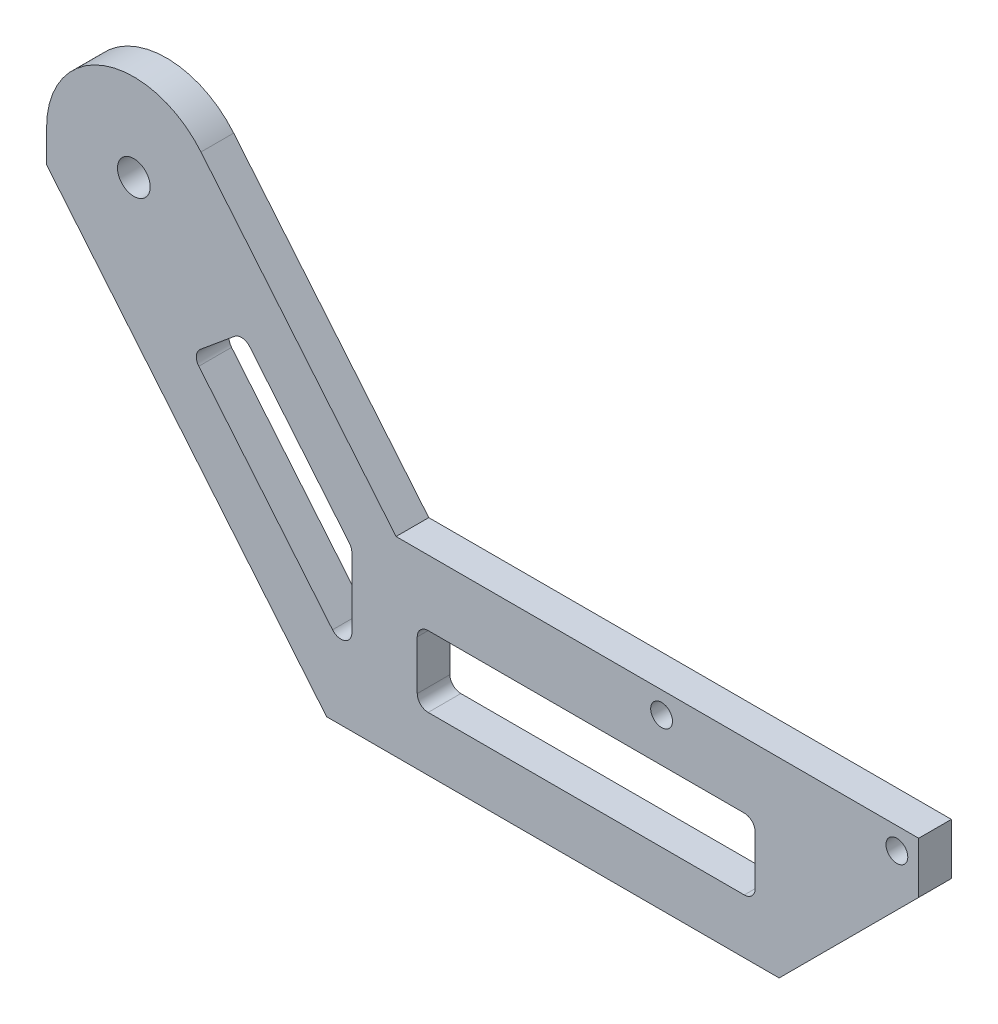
ISO-10303-21;
HEADER;
FILE_DESCRIPTION(('STEP AP214'),'2;1');
FILE_NAME('part.step','',(''),(''),'','','');
FILE_SCHEMA(('AUTOMOTIVE_DESIGN { 1 0 10303 214 1 1 1 1 }'));
ENDSEC;
DATA;
#1=APPLICATION_CONTEXT('core data for automotive mechanical design processes');
#2=APPLICATION_PROTOCOL_DEFINITION('international standard','automotive_design',2000,#1);
#3=PRODUCT_CONTEXT('',#1,'mechanical');
#4=PRODUCT('Part','Part','',(#3));
#5=PRODUCT_RELATED_PRODUCT_CATEGORY('part','',(#4));
#6=PRODUCT_DEFINITION_FORMATION('','',#4);
#7=PRODUCT_DEFINITION_CONTEXT('part definition',#1,'design');
#8=PRODUCT_DEFINITION('design','',#6,#7);
#9=PRODUCT_DEFINITION_SHAPE('','',#8);
#10=(LENGTH_UNIT() NAMED_UNIT(*) SI_UNIT(.MILLI.,.METRE.));
#11=(NAMED_UNIT(*) PLANE_ANGLE_UNIT() SI_UNIT($,.RADIAN.));
#12=(NAMED_UNIT(*) SI_UNIT($,.STERADIAN.) SOLID_ANGLE_UNIT());
#13=UNCERTAINTY_MEASURE_WITH_UNIT(LENGTH_MEASURE(1.E-05),#10,'distance_accuracy_value','');
#14=(GEOMETRIC_REPRESENTATION_CONTEXT(3) GLOBAL_UNCERTAINTY_ASSIGNED_CONTEXT((#13)) GLOBAL_UNIT_ASSIGNED_CONTEXT((#10,
#11,#12)) REPRESENTATION_CONTEXT('',''));
#15=CARTESIAN_POINT('',(0.,0.,0.));
#16=DIRECTION('',(0.,0.,1.));
#17=DIRECTION('',(1.,0.,0.));
#18=AXIS2_PLACEMENT_3D('',#15,#16,#17);
#19=CARTESIAN_POINT('',(0.,0.,4.7625));
#20=DIRECTION('',(0.,0.,-1.));
#21=DIRECTION('',(-1.,0.,0.));
#22=AXIS2_PLACEMENT_3D('',#19,#20,#21);
#23=PLANE('',#22);
#24=CARTESIAN_POINT('',(222.25,-58.7248,4.7625));
#25=DIRECTION('',(0.,0.,1.));
#26=DIRECTION('',(1.,0.,0.));
#27=AXIS2_PLACEMENT_3D('',#24,#25,#26);
#28=CIRCLE('',#27,3.175);
#29=CARTESIAN_POINT('',(219.075,-58.7248,4.7625));
#30=VERTEX_POINT('',#29);
#31=EDGE_CURVE('E387',#30,#30,#28,.T.);
#32=ORIENTED_EDGE('',*,*,#31,.F.);
#33=EDGE_LOOP('',(#32));
#34=FACE_BOUND('',#33,.T.);
#35=CARTESIAN_POINT('',(0.,0.,4.7625));
#36=DIRECTION('',(0.,0.,1.));
#37=DIRECTION('',(1.,0.,0.));
#38=AXIS2_PLACEMENT_3D('',#35,#36,#37);
#39=CIRCLE('',#38,4.7625);
#40=CARTESIAN_POINT('',(-4.7625,0.,4.7625));
#41=VERTEX_POINT('',#40);
#42=EDGE_CURVE('E221',#41,#41,#39,.T.);
#43=ORIENTED_EDGE('',*,*,#42,.F.);
#44=EDGE_LOOP('',(#43));
#45=FACE_BOUND('',#44,.T.);
#46=CARTESIAN_POINT('',(153.7208,-58.7248,4.7625));
#47=DIRECTION('',(0.,0.,1.));
#48=DIRECTION('',(1.,0.,0.));
#49=AXIS2_PLACEMENT_3D('',#46,#47,#48);
#50=CIRCLE('',#49,3.175);
#51=CARTESIAN_POINT('',(150.5458,-58.7248,4.7625));
#52=VERTEX_POINT('',#51);
#53=EDGE_CURVE('E393',#52,#52,#50,.T.);
#54=ORIENTED_EDGE('',*,*,#53,.F.);
#55=EDGE_LOOP('',(#54));
#56=FACE_BOUND('',#55,.T.);
#57=DIRECTION('',(0.770021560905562,0.638017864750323,0.));
#58=VECTOR('',#57,1.);
#59=CARTESIAN_POINT('',(24.4246700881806,-29.4780501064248,4.7625));
#60=LINE('',#59,#58);
#61=CARTESIAN_POINT('',(19.3535638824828,-33.6798238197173,4.7625));
#62=VERTEX_POINT('',#61);
#63=CARTESIAN_POINT('',(29.3143069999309,-25.4266366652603,4.7625));
#64=VERTEX_POINT('',#63);
#65=EDGE_CURVE('E365',#62,#64,#60,.T.);
#66=ORIENTED_EDGE('',*,*,#65,.T.);
#67=CARTESIAN_POINT('',(31.3400137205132,-27.8714551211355,4.7625));
#68=DIRECTION('',(0.,0.,-1.));
#69=DIRECTION('',(-1.,0.,0.));
#70=AXIS2_PLACEMENT_3D('',#67,#68,#69);
#71=CIRCLE('',#70,3.175);
#72=CARTESIAN_POINT('',(33.7848321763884,-25.8457484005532,4.7625));
#73=VERTEX_POINT('',#72);
#74=EDGE_CURVE('E308',#64,#73,#71,.T.);
#75=ORIENTED_EDGE('',*,*,#74,.T.);
#76=DIRECTION('',(0.638017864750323,-0.770021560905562,0.));
#77=VECTOR('',#76,1.);
#78=CARTESIAN_POINT('',(7.33445536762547,6.07712016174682,4.7625));
#79=LINE('',#78,#77);
#80=CARTESIAN_POINT('',(62.7698184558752,-60.8276283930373,4.7625));
#81=VERTEX_POINT('',#80);
#82=EDGE_CURVE('E362',#73,#81,#79,.T.);
#83=ORIENTED_EDGE('',*,*,#82,.T.);
#84=CARTESIAN_POINT('',(60.325,-62.8533351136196,4.7625));
#85=DIRECTION('',(0.,0.,-1.));
#86=DIRECTION('',(-1.,0.,0.));
#87=AXIS2_PLACEMENT_3D('',#84,#85,#86);
#88=CIRCLE('',#87,3.175);
#89=CARTESIAN_POINT('',(63.5,-62.8533351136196,4.7625));
#90=VERTEX_POINT('',#89);
#91=EDGE_CURVE('E312',#81,#90,#88,.T.);
#92=ORIENTED_EDGE('',*,*,#91,.T.);
#93=DIRECTION('',(0.,-1.,0.));
#94=VECTOR('',#93,1.);
#95=CARTESIAN_POINT('',(63.5,0.,4.7625));
#96=LINE('',#95,#94);
#97=CARTESIAN_POINT('',(63.5,-83.1281087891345,4.7625));
#98=VERTEX_POINT('',#97);
#99=EDGE_CURVE('E371',#90,#98,#96,.T.);
#100=ORIENTED_EDGE('',*,*,#99,.T.);
#101=CARTESIAN_POINT('',(60.325,-83.1281087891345,4.7625));
#102=DIRECTION('',(0.,0.,-1.));
#103=DIRECTION('',(-1.,0.,0.));
#104=AXIS2_PLACEMENT_3D('',#101,#102,#103);
#105=CIRCLE('',#104,3.175);
#106=CARTESIAN_POINT('',(57.8801815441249,-85.1538155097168,4.7625));
#107=VERTEX_POINT('',#106);
#108=EDGE_CURVE('E316',#98,#107,#105,.T.);
#109=ORIENTED_EDGE('',*,*,#108,.T.);
#110=DIRECTION('',(-0.638017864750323,0.770021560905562,0.));
#111=VECTOR('',#110,1.);
#112=CARTESIAN_POINT('',(-7.51592466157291,-6.2274804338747,4.7625));
#113=LINE('',#112,#111);
#114=CARTESIAN_POINT('',(18.93445214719,-38.1503489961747,4.7625));
#115=VERTEX_POINT('',#114);
#116=EDGE_CURVE('E368',#107,#115,#113,.T.);
#117=ORIENTED_EDGE('',*,*,#116,.T.);
#118=CARTESIAN_POINT('',(21.3792706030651,-36.1246422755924,4.7625));
#119=DIRECTION('',(0.,0.,-1.));
#120=DIRECTION('',(-1.,0.,0.));
#121=AXIS2_PLACEMENT_3D('',#118,#119,#120);
#122=CIRCLE('',#121,3.175);
#123=EDGE_CURVE('E304',#115,#62,#122,.T.);
#124=ORIENTED_EDGE('',*,*,#123,.T.);
#125=EDGE_LOOP('',(#66,#75,#83,#92,#100,#109,#117,#124));
#126=FACE_BOUND('',#125,.T.);
#127=DIRECTION('',(0.,1.,0.));
#128=VECTOR('',#127,1.);
#129=CARTESIAN_POINT('',(82.55,0.,4.7625));
#130=LINE('',#129,#128);
#131=CARTESIAN_POINT('',(82.55,-88.9,4.7625));
#132=VERTEX_POINT('',#131);
#133=CARTESIAN_POINT('',(82.55,-74.5998,4.7625));
#134=VERTEX_POINT('',#133);
#135=EDGE_CURVE('E353',#132,#134,#130,.T.);
#136=ORIENTED_EDGE('',*,*,#135,.T.);
#137=CARTESIAN_POINT('',(85.725,-74.5998,4.7625));
#138=DIRECTION('',(0.,0.,-1.));
#139=DIRECTION('',(-1.,0.,0.));
#140=AXIS2_PLACEMENT_3D('',#137,#138,#139);
#141=CIRCLE('',#140,3.175);
#142=CARTESIAN_POINT('',(85.725,-71.4248,4.7625));
#143=VERTEX_POINT('',#142);
#144=EDGE_CURVE('E328',#134,#143,#141,.T.);
#145=ORIENTED_EDGE('',*,*,#144,.T.);
#146=DIRECTION('',(1.,0.,0.));
#147=VECTOR('',#146,1.);
#148=CARTESIAN_POINT('',(0.,-71.4248,4.7625));
#149=LINE('',#148,#147);
#150=CARTESIAN_POINT('',(177.8,-71.4248,4.7625));
#151=VERTEX_POINT('',#150);
#152=EDGE_CURVE('E347',#143,#151,#149,.T.);
#153=ORIENTED_EDGE('',*,*,#152,.T.);
#154=CARTESIAN_POINT('',(177.8,-74.5998,4.7625));
#155=DIRECTION('',(0.,0.,-1.));
#156=DIRECTION('',(-1.,0.,0.));
#157=AXIS2_PLACEMENT_3D('',#154,#155,#156);
#158=CIRCLE('',#157,3.175);
#159=CARTESIAN_POINT('',(180.975,-74.5998,4.7625));
#160=VERTEX_POINT('',#159);
#161=EDGE_CURVE('E324',#151,#160,#158,.T.);
#162=ORIENTED_EDGE('',*,*,#161,.T.);
#163=DIRECTION('',(0.,-1.,0.));
#164=VECTOR('',#163,1.);
#165=CARTESIAN_POINT('',(180.975,0.,4.7625));
#166=LINE('',#165,#164);
#167=CARTESIAN_POINT('',(180.975,-88.9,4.7625));
#168=VERTEX_POINT('',#167);
#169=EDGE_CURVE('E359',#160,#168,#166,.T.);
#170=ORIENTED_EDGE('',*,*,#169,.T.);
#171=CARTESIAN_POINT('',(177.8,-88.9,4.7625));
#172=DIRECTION('',(0.,0.,-1.));
#173=DIRECTION('',(-1.,0.,0.));
#174=AXIS2_PLACEMENT_3D('',#171,#172,#173);
#175=CIRCLE('',#174,3.175);
#176=CARTESIAN_POINT('',(177.8,-92.075,4.7625));
#177=VERTEX_POINT('',#176);
#178=EDGE_CURVE('E320',#168,#177,#175,.T.);
#179=ORIENTED_EDGE('',*,*,#178,.T.);
#180=DIRECTION('',(-1.,0.,0.));
#181=VECTOR('',#180,1.);
#182=CARTESIAN_POINT('',(0.,-92.075,4.7625));
#183=LINE('',#182,#181);
#184=CARTESIAN_POINT('',(85.725,-92.075,4.7625));
#185=VERTEX_POINT('',#184);
#186=EDGE_CURVE('E356',#177,#185,#183,.T.);
#187=ORIENTED_EDGE('',*,*,#186,.T.);
#188=CARTESIAN_POINT('',(85.725,-88.9,4.7625));
#189=DIRECTION('',(0.,0.,-1.));
#190=DIRECTION('',(-1.,0.,0.));
#191=AXIS2_PLACEMENT_3D('',#188,#189,#190);
#192=CIRCLE('',#191,3.175);
#193=EDGE_CURVE('E332',#185,#132,#192,.T.);
#194=ORIENTED_EDGE('',*,*,#193,.T.);
#195=EDGE_LOOP('',(#136,#145,#153,#162,#170,#179,#187,#194));
#196=FACE_BOUND('',#195,.T.);
#197=DIRECTION('',(-1.,0.,0.));
#198=VECTOR('',#197,1.);
#199=CARTESIAN_POINT('',(0.,-107.95,4.7625));
#200=LINE('',#199,#198);
#201=CARTESIAN_POINT('',(187.96,-107.95,4.7625));
#202=VERTEX_POINT('',#201);
#203=CARTESIAN_POINT('',(56.1521428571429,-107.95,4.7625));
#204=VERTEX_POINT('',#203);
#205=EDGE_CURVE('E205',#202,#204,#200,.T.);
#206=ORIENTED_EDGE('',*,*,#205,.F.);
#207=DIRECTION('',(0.707106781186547,0.707106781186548,0.));
#208=VECTOR('',#207,1.);
#209=CARTESIAN_POINT('',(187.96,-107.95,4.7625));
#210=LINE('',#209,#208);
#211=CARTESIAN_POINT('',(228.6,-67.3099999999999,4.7625));
#212=VERTEX_POINT('',#211);
#213=EDGE_CURVE('E58',#202,#212,#210,.T.);
#214=ORIENTED_EDGE('',*,*,#213,.T.);
#215=DIRECTION('',(0.,1.,0.));
#216=VECTOR('',#215,1.);
#217=CARTESIAN_POINT('',(228.6,-52.3748,4.7625));
#218=LINE('',#217,#216);
#219=CARTESIAN_POINT('',(228.6,-52.3748,4.7625));
#220=VERTEX_POINT('',#219);
#221=EDGE_CURVE('E401',#212,#220,#218,.T.);
#222=ORIENTED_EDGE('',*,*,#221,.T.);
#223=DIRECTION('',(-1.,0.,0.));
#224=VECTOR('',#223,1.);
#225=CARTESIAN_POINT('',(107.95,-52.3748,4.7625));
#226=LINE('',#225,#224);
#227=CARTESIAN_POINT('',(76.382352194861,-52.3748,4.7625));
#228=VERTEX_POINT('',#227);
#229=EDGE_CURVE('E402',#220,#228,#226,.T.);
#230=ORIENTED_EDGE('',*,*,#229,.T.);
#231=DIRECTION('',(0.638017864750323,-0.770021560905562,0.));
#232=VECTOR('',#231,1.);
#233=CARTESIAN_POINT('',(19.5585476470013,16.2056537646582,4.7625));
#234=LINE('',#233,#232);
#235=CARTESIAN_POINT('',(19.5585476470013,16.2056537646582,4.7625));
#236=VERTEX_POINT('',#235);
#237=EDGE_CURVE('E344',#236,#228,#234,.T.);
#238=ORIENTED_EDGE('',*,*,#237,.F.);
#239=CARTESIAN_POINT('',(0.,0.,4.7625));
#240=DIRECTION('',(0.,0.,-1.));
#241=DIRECTION('',(-1.,0.,0.));
#242=AXIS2_PLACEMENT_3D('',#239,#240,#241);
#243=CIRCLE('',#242,25.4);
#244=CARTESIAN_POINT('',(-25.4,0.,4.7625));
#245=VERTEX_POINT('',#244);
#246=EDGE_CURVE('E206',#245,#236,#243,.T.);
#247=ORIENTED_EDGE('',*,*,#246,.F.);
#248=DIRECTION('',(0.,-1.,0.));
#249=VECTOR('',#248,1.);
#250=CARTESIAN_POINT('',(-25.4,25.4,4.7625));
#251=LINE('',#250,#249);
#252=CARTESIAN_POINT('',(-25.4,-9.525,4.7625));
#253=VERTEX_POINT('',#252);
#254=EDGE_CURVE('E229',#245,#253,#251,.T.);
#255=ORIENTED_EDGE('',*,*,#254,.T.);
#256=DIRECTION('',(0.638017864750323,-0.770021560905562,0.));
#257=VECTOR('',#256,1.);
#258=CARTESIAN_POINT('',(66.675,-120.65,4.7625));
#259=LINE('',#258,#257);
#260=EDGE_CURVE('E235',#253,#204,#259,.T.);
#261=ORIENTED_EDGE('',*,*,#260,.T.);
#262=EDGE_LOOP('',(#206,#214,#222,#230,#238,#247,#255,#261));
#263=FACE_BOUND('',#262,.T.);
#264=ADVANCED_FACE('F36',(#34,#45,#56,#126,#196,#263),#23,.F.);
#265=CARTESIAN_POINT('',(0.,0.,-4.7625));
#266=DIRECTION('',(0.,0.,-1.));
#267=DIRECTION('',(-1.,0.,0.));
#268=AXIS2_PLACEMENT_3D('',#265,#266,#267);
#269=PLANE('',#268);
#270=CARTESIAN_POINT('',(222.25,-58.7248,-4.7625));
#271=DIRECTION('',(0.,0.,1.));
#272=DIRECTION('',(1.,0.,0.));
#273=AXIS2_PLACEMENT_3D('',#270,#271,#272);
#274=CIRCLE('',#273,3.175);
#275=CARTESIAN_POINT('',(219.075,-58.7248,-4.7625));
#276=VERTEX_POINT('',#275);
#277=EDGE_CURVE('E384',#276,#276,#274,.T.);
#278=ORIENTED_EDGE('',*,*,#277,.T.);
#279=EDGE_LOOP('',(#278));
#280=FACE_BOUND('',#279,.T.);
#281=CARTESIAN_POINT('',(0.,0.,-4.7625));
#282=DIRECTION('',(0.,0.,1.));
#283=DIRECTION('',(1.,0.,0.));
#284=AXIS2_PLACEMENT_3D('',#281,#282,#283);
#285=CIRCLE('',#284,4.7625);
#286=CARTESIAN_POINT('',(-4.7625,0.,-4.7625));
#287=VERTEX_POINT('',#286);
#288=EDGE_CURVE('E226',#287,#287,#285,.T.);
#289=ORIENTED_EDGE('',*,*,#288,.T.);
#290=EDGE_LOOP('',(#289));
#291=FACE_BOUND('',#290,.T.);
#292=CARTESIAN_POINT('',(153.7208,-58.7248,-4.7625));
#293=DIRECTION('',(0.,0.,1.));
#294=DIRECTION('',(1.,0.,0.));
#295=AXIS2_PLACEMENT_3D('',#292,#293,#294);
#296=CIRCLE('',#295,3.175);
#297=CARTESIAN_POINT('',(150.5458,-58.7248,-4.7625));
#298=VERTEX_POINT('',#297);
#299=EDGE_CURVE('E390',#298,#298,#296,.T.);
#300=ORIENTED_EDGE('',*,*,#299,.T.);
#301=EDGE_LOOP('',(#300));
#302=FACE_BOUND('',#301,.T.);
#303=DIRECTION('',(0.,-1.,0.));
#304=VECTOR('',#303,1.);
#305=CARTESIAN_POINT('',(63.5,0.,-4.7625));
#306=LINE('',#305,#304);
#307=CARTESIAN_POINT('',(63.5,-62.8533351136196,-4.7625));
#308=VERTEX_POINT('',#307);
#309=CARTESIAN_POINT('',(63.5,-83.1281087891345,-4.7625));
#310=VERTEX_POINT('',#309);
#311=EDGE_CURVE('E249',#308,#310,#306,.T.);
#312=ORIENTED_EDGE('',*,*,#311,.F.);
#313=CARTESIAN_POINT('',(60.325,-62.8533351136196,-4.7625));
#314=DIRECTION('',(0.,0.,-1.));
#315=DIRECTION('',(-1.,0.,0.));
#316=AXIS2_PLACEMENT_3D('',#313,#314,#315);
#317=CIRCLE('',#316,3.175);
#318=CARTESIAN_POINT('',(62.7698184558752,-60.8276283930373,-4.7625));
#319=VERTEX_POINT('',#318);
#320=EDGE_CURVE('E314',#308,#319,#317,.F.);
#321=ORIENTED_EDGE('',*,*,#320,.T.);
#322=DIRECTION('',(0.638017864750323,-0.770021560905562,0.));
#323=VECTOR('',#322,1.);
#324=CARTESIAN_POINT('',(7.33445536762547,6.07712016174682,-4.7625));
#325=LINE('',#324,#323);
#326=CARTESIAN_POINT('',(33.7848321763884,-25.8457484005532,-4.7625));
#327=VERTEX_POINT('',#326);
#328=EDGE_CURVE('E240',#327,#319,#325,.T.);
#329=ORIENTED_EDGE('',*,*,#328,.F.);
#330=CARTESIAN_POINT('',(31.3400137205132,-27.8714551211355,-4.7625));
#331=DIRECTION('',(0.,0.,-1.));
#332=DIRECTION('',(-1.,0.,0.));
#333=AXIS2_PLACEMENT_3D('',#330,#331,#332);
#334=CIRCLE('',#333,3.175);
#335=CARTESIAN_POINT('',(29.3143069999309,-25.4266366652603,-4.7625));
#336=VERTEX_POINT('',#335);
#337=EDGE_CURVE('E310',#327,#336,#334,.F.);
#338=ORIENTED_EDGE('',*,*,#337,.T.);
#339=DIRECTION('',(0.770021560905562,0.638017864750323,0.));
#340=VECTOR('',#339,1.);
#341=CARTESIAN_POINT('',(24.4246700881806,-29.4780501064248,-4.7625));
#342=LINE('',#341,#340);
#343=CARTESIAN_POINT('',(19.3535638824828,-33.6798238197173,-4.7625));
#344=VERTEX_POINT('',#343);
#345=EDGE_CURVE('E243',#344,#336,#342,.T.);
#346=ORIENTED_EDGE('',*,*,#345,.F.);
#347=CARTESIAN_POINT('',(21.3792706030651,-36.1246422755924,-4.7625));
#348=DIRECTION('',(0.,0.,-1.));
#349=DIRECTION('',(-1.,0.,0.));
#350=AXIS2_PLACEMENT_3D('',#347,#348,#349);
#351=CIRCLE('',#350,3.175);
#352=CARTESIAN_POINT('',(18.93445214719,-38.1503489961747,-4.7625));
#353=VERTEX_POINT('',#352);
#354=EDGE_CURVE('E306',#344,#353,#351,.F.);
#355=ORIENTED_EDGE('',*,*,#354,.T.);
#356=DIRECTION('',(-0.638017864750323,0.770021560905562,0.));
#357=VECTOR('',#356,1.);
#358=CARTESIAN_POINT('',(-7.51592466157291,-6.2274804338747,-4.7625));
#359=LINE('',#358,#357);
#360=CARTESIAN_POINT('',(57.8801815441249,-85.1538155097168,-4.7625));
#361=VERTEX_POINT('',#360);
#362=EDGE_CURVE('E246',#361,#353,#359,.T.);
#363=ORIENTED_EDGE('',*,*,#362,.F.);
#364=CARTESIAN_POINT('',(60.325,-83.1281087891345,-4.7625));
#365=DIRECTION('',(0.,0.,-1.));
#366=DIRECTION('',(-1.,0.,0.));
#367=AXIS2_PLACEMENT_3D('',#364,#365,#366);
#368=CIRCLE('',#367,3.175);
#369=EDGE_CURVE('E318',#361,#310,#368,.F.);
#370=ORIENTED_EDGE('',*,*,#369,.T.);
#371=EDGE_LOOP('',(#312,#321,#329,#338,#346,#355,#363,#370));
#372=FACE_BOUND('',#371,.T.);
#373=DIRECTION('',(0.,-1.,0.));
#374=VECTOR('',#373,1.);
#375=CARTESIAN_POINT('',(180.975,0.,-4.7625));
#376=LINE('',#375,#374);
#377=CARTESIAN_POINT('',(180.975,-74.5998,-4.7625));
#378=VERTEX_POINT('',#377);
#379=CARTESIAN_POINT('',(180.975,-88.9,-4.7625));
#380=VERTEX_POINT('',#379);
#381=EDGE_CURVE('E261',#378,#380,#376,.T.);
#382=ORIENTED_EDGE('',*,*,#381,.F.);
#383=CARTESIAN_POINT('',(177.8,-74.5998,-4.7625));
#384=DIRECTION('',(0.,0.,-1.));
#385=DIRECTION('',(-1.,0.,0.));
#386=AXIS2_PLACEMENT_3D('',#383,#384,#385);
#387=CIRCLE('',#386,3.175);
#388=CARTESIAN_POINT('',(177.8,-71.4248,-4.7625));
#389=VERTEX_POINT('',#388);
#390=EDGE_CURVE('E326',#378,#389,#387,.F.);
#391=ORIENTED_EDGE('',*,*,#390,.T.);
#392=DIRECTION('',(1.,0.,0.));
#393=VECTOR('',#392,1.);
#394=CARTESIAN_POINT('',(0.,-71.4248,-4.7625));
#395=LINE('',#394,#393);
#396=CARTESIAN_POINT('',(85.725,-71.4248,-4.7625));
#397=VERTEX_POINT('',#396);
#398=EDGE_CURVE('E252',#397,#389,#395,.T.);
#399=ORIENTED_EDGE('',*,*,#398,.F.);
#400=CARTESIAN_POINT('',(85.725,-74.5998,-4.7625));
#401=DIRECTION('',(0.,0.,-1.));
#402=DIRECTION('',(-1.,0.,0.));
#403=AXIS2_PLACEMENT_3D('',#400,#401,#402);
#404=CIRCLE('',#403,3.175);
#405=CARTESIAN_POINT('',(82.55,-74.5998,-4.7625));
#406=VERTEX_POINT('',#405);
#407=EDGE_CURVE('E330',#397,#406,#404,.F.);
#408=ORIENTED_EDGE('',*,*,#407,.T.);
#409=DIRECTION('',(0.,1.,0.));
#410=VECTOR('',#409,1.);
#411=CARTESIAN_POINT('',(82.55,0.,-4.7625));
#412=LINE('',#411,#410);
#413=CARTESIAN_POINT('',(82.55,-88.9,-4.7625));
#414=VERTEX_POINT('',#413);
#415=EDGE_CURVE('E255',#414,#406,#412,.T.);
#416=ORIENTED_EDGE('',*,*,#415,.F.);
#417=CARTESIAN_POINT('',(85.725,-88.9,-4.7625));
#418=DIRECTION('',(0.,0.,-1.));
#419=DIRECTION('',(-1.,0.,0.));
#420=AXIS2_PLACEMENT_3D('',#417,#418,#419);
#421=CIRCLE('',#420,3.175);
#422=CARTESIAN_POINT('',(85.725,-92.075,-4.7625));
#423=VERTEX_POINT('',#422);
#424=EDGE_CURVE('E334',#414,#423,#421,.F.);
#425=ORIENTED_EDGE('',*,*,#424,.T.);
#426=DIRECTION('',(-1.,0.,0.));
#427=VECTOR('',#426,1.);
#428=CARTESIAN_POINT('',(0.,-92.075,-4.7625));
#429=LINE('',#428,#427);
#430=CARTESIAN_POINT('',(177.8,-92.075,-4.7625));
#431=VERTEX_POINT('',#430);
#432=EDGE_CURVE('E258',#431,#423,#429,.T.);
#433=ORIENTED_EDGE('',*,*,#432,.F.);
#434=CARTESIAN_POINT('',(177.8,-88.9,-4.7625));
#435=DIRECTION('',(0.,0.,-1.));
#436=DIRECTION('',(-1.,0.,0.));
#437=AXIS2_PLACEMENT_3D('',#434,#435,#436);
#438=CIRCLE('',#437,3.175);
#439=EDGE_CURVE('E322',#431,#380,#438,.F.);
#440=ORIENTED_EDGE('',*,*,#439,.T.);
#441=EDGE_LOOP('',(#382,#391,#399,#408,#416,#425,#433,#440));
#442=FACE_BOUND('',#441,.T.);
#443=DIRECTION('',(0.,1.,0.));
#444=VECTOR('',#443,1.);
#445=CARTESIAN_POINT('',(228.6,-52.3748,-4.7625));
#446=LINE('',#445,#444);
#447=CARTESIAN_POINT('',(228.6,-67.3099999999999,-4.7625));
#448=VERTEX_POINT('',#447);
#449=CARTESIAN_POINT('',(228.6,-52.3748,-4.7625));
#450=VERTEX_POINT('',#449);
#451=EDGE_CURVE('E220',#448,#450,#446,.T.);
#452=ORIENTED_EDGE('',*,*,#451,.F.);
#453=DIRECTION('',(-0.707106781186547,-0.707106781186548,0.));
#454=VECTOR('',#453,1.);
#455=CARTESIAN_POINT('',(147.955,-147.955,-4.7625));
#456=LINE('',#455,#454);
#457=CARTESIAN_POINT('',(187.96,-107.95,-4.7625));
#458=VERTEX_POINT('',#457);
#459=EDGE_CURVE('E12',#448,#458,#456,.T.);
#460=ORIENTED_EDGE('',*,*,#459,.T.);
#461=DIRECTION('',(-1.,0.,0.));
#462=VECTOR('',#461,1.);
#463=CARTESIAN_POINT('',(0.,-107.95,-4.7625));
#464=LINE('',#463,#462);
#465=CARTESIAN_POINT('',(56.1521428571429,-107.95,-4.7625));
#466=VERTEX_POINT('',#465);
#467=EDGE_CURVE('E195',#458,#466,#464,.T.);
#468=ORIENTED_EDGE('',*,*,#467,.T.);
#469=DIRECTION('',(0.638017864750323,-0.770021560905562,0.));
#470=VECTOR('',#469,1.);
#471=CARTESIAN_POINT('',(66.675,-120.65,-4.7625));
#472=LINE('',#471,#470);
#473=CARTESIAN_POINT('',(-25.4,-9.525,-4.7625));
#474=VERTEX_POINT('',#473);
#475=EDGE_CURVE('E200',#474,#466,#472,.T.);
#476=ORIENTED_EDGE('',*,*,#475,.F.);
#477=DIRECTION('',(0.,-1.,0.));
#478=VECTOR('',#477,1.);
#479=CARTESIAN_POINT('',(-25.4,25.4,-4.7625));
#480=LINE('',#479,#478);
#481=CARTESIAN_POINT('',(-25.4,0.,-4.7625));
#482=VERTEX_POINT('',#481);
#483=EDGE_CURVE('E233',#482,#474,#480,.T.);
#484=ORIENTED_EDGE('',*,*,#483,.F.);
#485=CARTESIAN_POINT('',(0.,0.,-4.7625));
#486=DIRECTION('',(0.,0.,-1.));
#487=DIRECTION('',(-1.,0.,0.));
#488=AXIS2_PLACEMENT_3D('',#485,#486,#487);
#489=CIRCLE('',#488,25.4);
#490=CARTESIAN_POINT('',(19.5585476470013,16.2056537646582,-4.7625));
#491=VERTEX_POINT('',#490);
#492=EDGE_CURVE('E410',#482,#491,#489,.T.);
#493=ORIENTED_EDGE('',*,*,#492,.T.);
#494=DIRECTION('',(0.638017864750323,-0.770021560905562,0.));
#495=VECTOR('',#494,1.);
#496=CARTESIAN_POINT('',(19.5585476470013,16.2056537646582,-4.7625));
#497=LINE('',#496,#495);
#498=CARTESIAN_POINT('',(76.382352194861,-52.3748,-4.7625));
#499=VERTEX_POINT('',#498);
#500=EDGE_CURVE('E338',#491,#499,#497,.T.);
#501=ORIENTED_EDGE('',*,*,#500,.T.);
#502=DIRECTION('',(-1.,0.,0.));
#503=VECTOR('',#502,1.);
#504=CARTESIAN_POINT('',(107.95,-52.3748,-4.7625));
#505=LINE('',#504,#503);
#506=EDGE_CURVE('E223',#450,#499,#505,.T.);
#507=ORIENTED_EDGE('',*,*,#506,.F.);
#508=EDGE_LOOP('',(#452,#460,#468,#476,#484,#493,#501,#507));
#509=FACE_BOUND('',#508,.T.);
#510=ADVANCED_FACE('F197',(#280,#291,#302,#372,#442,#509),#269,.T.);
#511=CARTESIAN_POINT('',(66.675,-120.65,4.7625));
#512=DIRECTION('',(0.770021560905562,0.638017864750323,0.));
#513=DIRECTION('',(-0.638017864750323,0.770021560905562,0.));
#514=AXIS2_PLACEMENT_3D('',#511,#512,#513);
#515=PLANE('',#514);
#516=CARTESIAN_POINT('',(-21.3485865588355,-14.4146369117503,0.));
#517=DIRECTION('',(-0.770021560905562,-0.638017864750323,0.));
#518=DIRECTION('',(0.638017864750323,-0.770021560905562,0.));
#519=AXIS2_PLACEMENT_3D('',#516,#517,#518);
#520=CIRCLE('',#519,2.3876);
#521=CARTESIAN_POINT('',(-19.8252551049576,-16.2531403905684,0.));
#522=VERTEX_POINT('',#521);
#523=EDGE_CURVE('E378',#522,#522,#520,.T.);
#524=ORIENTED_EDGE('',*,*,#523,.F.);
#525=EDGE_LOOP('',(#524));
#526=FACE_BOUND('',#525,.T.);
#527=CARTESIAN_POINT('',(-5.14293279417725,-33.9731845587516,0.));
#528=DIRECTION('',(-0.770021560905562,-0.638017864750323,0.));
#529=DIRECTION('',(0.638017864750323,-0.770021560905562,0.));
#530=AXIS2_PLACEMENT_3D('',#527,#528,#529);
#531=CIRCLE('',#530,2.3876);
#532=CARTESIAN_POINT('',(-3.61960134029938,-35.8116880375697,0.));
#533=VERTEX_POINT('',#532);
#534=EDGE_CURVE('E374',#533,#533,#531,.T.);
#535=ORIENTED_EDGE('',*,*,#534,.F.);
#536=EDGE_LOOP('',(#535));
#537=FACE_BOUND('',#536,.T.);
#538=DIRECTION('',(0.,0.,1.));
#539=VECTOR('',#538,1.);
#540=CARTESIAN_POINT('',(56.1521428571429,-107.95,-12.7));
#541=LINE('',#540,#539);
#542=EDGE_CURVE('E209',#466,#204,#541,.T.);
#543=ORIENTED_EDGE('',*,*,#542,.T.);
#544=ORIENTED_EDGE('',*,*,#260,.F.);
#545=DIRECTION('',(0.,0.,-1.));
#546=VECTOR('',#545,1.);
#547=CARTESIAN_POINT('',(-25.4,-9.525,4.7625));
#548=LINE('',#547,#546);
#549=EDGE_CURVE('E219',#253,#474,#548,.T.);
#550=ORIENTED_EDGE('',*,*,#549,.T.);
#551=ORIENTED_EDGE('',*,*,#475,.T.);
#552=EDGE_LOOP('',(#543,#544,#550,#551));
#553=FACE_BOUND('',#552,.T.);
#554=ADVANCED_FACE('F217',(#526,#537,#553),#515,.F.);
#555=CARTESIAN_POINT('',(228.6,-52.3748,4.7625));
#556=DIRECTION('',(-1.,0.,0.));
#557=DIRECTION('',(0.,-1.,0.));
#558=AXIS2_PLACEMENT_3D('',#555,#556,#557);
#559=PLANE('',#558);
#560=ORIENTED_EDGE('',*,*,#221,.F.);
#561=DIRECTION('',(0.,0.,-1.));
#562=VECTOR('',#561,1.);
#563=CARTESIAN_POINT('',(228.6,-67.3099999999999,-4.7625));
#564=LINE('',#563,#562);
#565=EDGE_CURVE('E44',#212,#448,#564,.T.);
#566=ORIENTED_EDGE('',*,*,#565,.T.);
#567=ORIENTED_EDGE('',*,*,#451,.T.);
#568=DIRECTION('',(0.,0.,-1.));
#569=VECTOR('',#568,1.);
#570=CARTESIAN_POINT('',(228.6,-52.3748,4.7625));
#571=LINE('',#570,#569);
#572=EDGE_CURVE('E237',#220,#450,#571,.T.);
#573=ORIENTED_EDGE('',*,*,#572,.F.);
#574=EDGE_LOOP('',(#560,#566,#567,#573));
#575=FACE_BOUND('',#574,.T.);
#576=ADVANCED_FACE('F449',(#575),#559,.F.);
#577=CARTESIAN_POINT('',(-25.4,25.4,4.7625));
#578=DIRECTION('',(1.,0.,0.));
#579=DIRECTION('',(0.,0.,-1.));
#580=AXIS2_PLACEMENT_3D('',#577,#578,#579);
#581=PLANE('',#580);
#582=DIRECTION('',(0.,0.,1.));
#583=VECTOR('',#582,1.);
#584=CARTESIAN_POINT('',(-25.4,0.,-12.7));
#585=LINE('',#584,#583);
#586=EDGE_CURVE('E336',#482,#245,#585,.T.);
#587=ORIENTED_EDGE('',*,*,#586,.F.);
#588=ORIENTED_EDGE('',*,*,#483,.T.);
#589=ORIENTED_EDGE('',*,*,#549,.F.);
#590=ORIENTED_EDGE('',*,*,#254,.F.);
#591=EDGE_LOOP('',(#587,#588,#589,#590));
#592=FACE_BOUND('',#591,.T.);
#593=ADVANCED_FACE('F409',(#592),#581,.F.);
#594=CARTESIAN_POINT('',(107.95,-52.3748,4.7625));
#595=DIRECTION('',(0.,-1.,0.));
#596=DIRECTION('',(0.,0.,-1.));
#597=AXIS2_PLACEMENT_3D('',#594,#595,#596);
#598=PLANE('',#597);
#599=ORIENTED_EDGE('',*,*,#506,.T.);
#600=DIRECTION('',(0.,0.,1.));
#601=VECTOR('',#600,1.);
#602=CARTESIAN_POINT('',(76.382352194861,-52.3748,-12.7));
#603=LINE('',#602,#601);
#604=EDGE_CURVE('E214',#499,#228,#603,.T.);
#605=ORIENTED_EDGE('',*,*,#604,.T.);
#606=ORIENTED_EDGE('',*,*,#229,.F.);
#607=ORIENTED_EDGE('',*,*,#572,.T.);
#608=EDGE_LOOP('',(#599,#605,#606,#607));
#609=FACE_BOUND('',#608,.T.);
#610=ADVANCED_FACE('F426',(#609),#598,.F.);
#611=CARTESIAN_POINT('',(0.,0.,4.7625));
#612=DIRECTION('',(0.,0.,-1.));
#613=DIRECTION('',(-1.,0.,0.));
#614=AXIS2_PLACEMENT_3D('',#611,#612,#613);
#615=CYLINDRICAL_SURFACE('',#614,4.7625);
#616=CARTESIAN_POINT('',(-4.7625,0.,4.7625));
#617=CARTESIAN_POINT('',(-4.7625,0.,4.66328125));
#618=CARTESIAN_POINT('',(-4.7625,0.,4.5640625));
#619=CARTESIAN_POINT('',(-4.7625,0.,4.365625));
#620=CARTESIAN_POINT('',(-4.7625,0.,4.26640625));
#621=CARTESIAN_POINT('',(-4.7625,0.,4.06796875));
#622=CARTESIAN_POINT('',(-4.7625,0.,3.96875));
#623=CARTESIAN_POINT('',(-4.7625,0.,3.7703125));
#624=CARTESIAN_POINT('',(-4.7625,0.,3.67109375));
#625=CARTESIAN_POINT('',(-4.7625,0.,3.47265625));
#626=CARTESIAN_POINT('',(-4.7625,0.,3.3734375));
#627=CARTESIAN_POINT('',(-4.7625,0.,3.175));
#628=CARTESIAN_POINT('',(-4.7625,0.,3.07578125));
#629=CARTESIAN_POINT('',(-4.7625,0.,2.87734375));
#630=CARTESIAN_POINT('',(-4.7625,0.,2.778125));
#631=CARTESIAN_POINT('',(-4.7625,0.,2.5796875));
#632=CARTESIAN_POINT('',(-4.7625,0.,2.48046875));
#633=CARTESIAN_POINT('',(-4.7625,0.,2.28203125));
#634=CARTESIAN_POINT('',(-4.7625,0.,2.1828125));
#635=CARTESIAN_POINT('',(-4.7625,0.,1.984375));
#636=CARTESIAN_POINT('',(-4.7625,0.,1.88515625));
#637=CARTESIAN_POINT('',(-4.7625,0.,1.68671875));
#638=CARTESIAN_POINT('',(-4.7625,0.,1.5875));
#639=CARTESIAN_POINT('',(-4.7625,0.,1.3890625));
#640=CARTESIAN_POINT('',(-4.7625,0.,1.28984375));
#641=CARTESIAN_POINT('',(-4.7625,0.,1.09140625));
#642=CARTESIAN_POINT('',(-4.7625,0.,0.992187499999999));
#643=CARTESIAN_POINT('',(-4.7625,0.,0.79375));
#644=CARTESIAN_POINT('',(-4.7625,0.,0.69453125));
#645=CARTESIAN_POINT('',(-4.7625,0.,0.49609375));
#646=CARTESIAN_POINT('',(-4.7625,0.,0.396875));
#647=CARTESIAN_POINT('',(-4.7625,0.,0.1984375));
#648=CARTESIAN_POINT('',(-4.7625,0.,0.0992187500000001));
#649=CARTESIAN_POINT('',(-4.7625,0.,-0.0992187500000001));
#650=CARTESIAN_POINT('',(-4.7625,0.,-0.1984375));
#651=CARTESIAN_POINT('',(-4.7625,0.,-0.396875));
#652=CARTESIAN_POINT('',(-4.7625,0.,-0.49609375));
#653=CARTESIAN_POINT('',(-4.7625,0.,-0.69453125));
#654=CARTESIAN_POINT('',(-4.7625,0.,-0.793750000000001));
#655=CARTESIAN_POINT('',(-4.7625,0.,-0.992187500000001));
#656=CARTESIAN_POINT('',(-4.7625,0.,-1.09140625));
#657=CARTESIAN_POINT('',(-4.7625,0.,-1.28984375));
#658=CARTESIAN_POINT('',(-4.7625,0.,-1.3890625));
#659=CARTESIAN_POINT('',(-4.7625,0.,-1.5875));
#660=CARTESIAN_POINT('',(-4.7625,0.,-1.68671875));
#661=CARTESIAN_POINT('',(-4.7625,0.,-1.88515625));
#662=CARTESIAN_POINT('',(-4.7625,0.,-1.984375));
#663=CARTESIAN_POINT('',(-4.7625,0.,-2.1828125));
#664=CARTESIAN_POINT('',(-4.7625,0.,-2.28203125));
#665=CARTESIAN_POINT('',(-4.7625,0.,-2.48046875));
#666=CARTESIAN_POINT('',(-4.7625,0.,-2.5796875));
#667=CARTESIAN_POINT('',(-4.7625,0.,-2.778125));
#668=CARTESIAN_POINT('',(-4.7625,0.,-2.87734375));
#669=CARTESIAN_POINT('',(-4.7625,0.,-3.07578125));
#670=CARTESIAN_POINT('',(-4.7625,0.,-3.175));
#671=CARTESIAN_POINT('',(-4.7625,0.,-3.3734375));
#672=CARTESIAN_POINT('',(-4.7625,0.,-3.47265625));
#673=CARTESIAN_POINT('',(-4.7625,0.,-3.67109375));
#674=CARTESIAN_POINT('',(-4.7625,0.,-3.7703125));
#675=CARTESIAN_POINT('',(-4.7625,0.,-3.96875));
#676=CARTESIAN_POINT('',(-4.7625,0.,-4.06796875));
#677=CARTESIAN_POINT('',(-4.7625,0.,-4.26640625));
#678=CARTESIAN_POINT('',(-4.7625,0.,-4.365625));
#679=CARTESIAN_POINT('',(-4.7625,0.,-4.5640625));
#680=CARTESIAN_POINT('',(-4.7625,0.,-4.66328125));
#681=CARTESIAN_POINT('',(-4.7625,0.,-4.7625));
#682=B_SPLINE_CURVE_WITH_KNOTS('',3,(#616,#617,#618,#619,#620,#621,#622,#623,#624,#625,#626,
#627,#628,#629,#630,#631,#632,#633,#634,#635,#636,#637,#638,#639,#640,#641,#642,#643,#644,#645,
#646,#647,#648,#649,#650,#651,#652,#653,#654,#655,#656,#657,#658,#659,#660,#661,#662,#663,#664,
#665,#666,#667,#668,#669,#670,#671,#672,#673,#674,#675,#676,#677,#678,#679,#680,#681),
.UNSPECIFIED.,.F.,.F.,(4,2,2,2,2,2,2,2,2,2,2,2,2,2,2,2,2,2,2,2,2,2,2,2,2,2,2,2,2,2,2,2,4),(0.,
0.29765625,0.5953125,0.892968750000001,1.190625,1.48828125,1.7859375,2.08359375,2.38125,
2.67890625,2.9765625,3.27421875,3.571875,3.86953125,4.1671875,4.46484375,4.7625,5.06015625,
5.3578125,5.65546875,5.953125,6.25078125,6.5484375,6.84609375,7.14375,7.44140625,7.7390625,
8.03671875,8.334375,8.63203125,8.9296875,9.22734375,9.525),.UNSPECIFIED.);
#683=EDGE_CURVE('BSEAM444',#41,#287,#682,.T.);
#684=ORIENTED_EDGE('',*,*,#42,.T.);
#685=ORIENTED_EDGE('',*,*,#288,.F.);
#686=ORIENTED_EDGE('',*,*,#683,.T.);
#687=ORIENTED_EDGE('',*,*,#683,.F.);
#688=EDGE_LOOP('',(#684,#686,#685,#687));
#689=FACE_BOUND('',#688,.T.);
#690=ADVANCED_FACE('F444',(#689),#615,.F.);
#691=CARTESIAN_POINT('',(153.7208,-58.7248,4.7625));
#692=DIRECTION('',(0.,0.,-1.));
#693=DIRECTION('',(-1.,0.,0.));
#694=AXIS2_PLACEMENT_3D('',#691,#692,#693);
#695=CYLINDRICAL_SURFACE('',#694,3.175);
#696=CARTESIAN_POINT('',(150.5458,-58.7248,4.7625));
#697=CARTESIAN_POINT('',(150.5458,-58.7248,4.66328125));
#698=CARTESIAN_POINT('',(150.5458,-58.7248,4.5640625));
#699=CARTESIAN_POINT('',(150.5458,-58.7248,4.365625));
#700=CARTESIAN_POINT('',(150.5458,-58.7248,4.26640625));
#701=CARTESIAN_POINT('',(150.5458,-58.7248,4.06796875));
#702=CARTESIAN_POINT('',(150.5458,-58.7248,3.96875));
#703=CARTESIAN_POINT('',(150.5458,-58.7248,3.7703125));
#704=CARTESIAN_POINT('',(150.5458,-58.7248,3.67109375));
#705=CARTESIAN_POINT('',(150.5458,-58.7248,3.47265625));
#706=CARTESIAN_POINT('',(150.5458,-58.7248,3.3734375));
#707=CARTESIAN_POINT('',(150.5458,-58.7248,3.175));
#708=CARTESIAN_POINT('',(150.5458,-58.7248,3.07578125));
#709=CARTESIAN_POINT('',(150.5458,-58.7248,2.87734375));
#710=CARTESIAN_POINT('',(150.5458,-58.7248,2.778125));
#711=CARTESIAN_POINT('',(150.5458,-58.7248,2.5796875));
#712=CARTESIAN_POINT('',(150.5458,-58.7248,2.48046875));
#713=CARTESIAN_POINT('',(150.5458,-58.7248,2.28203125));
#714=CARTESIAN_POINT('',(150.5458,-58.7248,2.1828125));
#715=CARTESIAN_POINT('',(150.5458,-58.7248,1.984375));
#716=CARTESIAN_POINT('',(150.5458,-58.7248,1.88515625));
#717=CARTESIAN_POINT('',(150.5458,-58.7248,1.68671875));
#718=CARTESIAN_POINT('',(150.5458,-58.7248,1.5875));
#719=CARTESIAN_POINT('',(150.5458,-58.7248,1.3890625));
#720=CARTESIAN_POINT('',(150.5458,-58.7248,1.28984375));
#721=CARTESIAN_POINT('',(150.5458,-58.7248,1.09140625));
#722=CARTESIAN_POINT('',(150.5458,-58.7248,0.992187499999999));
#723=CARTESIAN_POINT('',(150.5458,-58.7248,0.79375));
#724=CARTESIAN_POINT('',(150.5458,-58.7248,0.69453125));
#725=CARTESIAN_POINT('',(150.5458,-58.7248,0.49609375));
#726=CARTESIAN_POINT('',(150.5458,-58.7248,0.396875));
#727=CARTESIAN_POINT('',(150.5458,-58.7248,0.1984375));
#728=CARTESIAN_POINT('',(150.5458,-58.7248,0.0992187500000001));
#729=CARTESIAN_POINT('',(150.5458,-58.7248,-0.0992187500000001));
#730=CARTESIAN_POINT('',(150.5458,-58.7248,-0.1984375));
#731=CARTESIAN_POINT('',(150.5458,-58.7248,-0.396875));
#732=CARTESIAN_POINT('',(150.5458,-58.7248,-0.49609375));
#733=CARTESIAN_POINT('',(150.5458,-58.7248,-0.69453125));
#734=CARTESIAN_POINT('',(150.5458,-58.7248,-0.793750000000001));
#735=CARTESIAN_POINT('',(150.5458,-58.7248,-0.992187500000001));
#736=CARTESIAN_POINT('',(150.5458,-58.7248,-1.09140625));
#737=CARTESIAN_POINT('',(150.5458,-58.7248,-1.28984375));
#738=CARTESIAN_POINT('',(150.5458,-58.7248,-1.3890625));
#739=CARTESIAN_POINT('',(150.5458,-58.7248,-1.5875));
#740=CARTESIAN_POINT('',(150.5458,-58.7248,-1.68671875));
#741=CARTESIAN_POINT('',(150.5458,-58.7248,-1.88515625));
#742=CARTESIAN_POINT('',(150.5458,-58.7248,-1.984375));
#743=CARTESIAN_POINT('',(150.5458,-58.7248,-2.1828125));
#744=CARTESIAN_POINT('',(150.5458,-58.7248,-2.28203125));
#745=CARTESIAN_POINT('',(150.5458,-58.7248,-2.48046875));
#746=CARTESIAN_POINT('',(150.5458,-58.7248,-2.5796875));
#747=CARTESIAN_POINT('',(150.5458,-58.7248,-2.778125));
#748=CARTESIAN_POINT('',(150.5458,-58.7248,-2.87734375));
#749=CARTESIAN_POINT('',(150.5458,-58.7248,-3.07578125));
#750=CARTESIAN_POINT('',(150.5458,-58.7248,-3.175));
#751=CARTESIAN_POINT('',(150.5458,-58.7248,-3.3734375));
#752=CARTESIAN_POINT('',(150.5458,-58.7248,-3.47265625));
#753=CARTESIAN_POINT('',(150.5458,-58.7248,-3.67109375));
#754=CARTESIAN_POINT('',(150.5458,-58.7248,-3.7703125));
#755=CARTESIAN_POINT('',(150.5458,-58.7248,-3.96875));
#756=CARTESIAN_POINT('',(150.5458,-58.7248,-4.06796875));
#757=CARTESIAN_POINT('',(150.5458,-58.7248,-4.26640625));
#758=CARTESIAN_POINT('',(150.5458,-58.7248,-4.365625));
#759=CARTESIAN_POINT('',(150.5458,-58.7248,-4.5640625));
#760=CARTESIAN_POINT('',(150.5458,-58.7248,-4.66328125));
#761=CARTESIAN_POINT('',(150.5458,-58.7248,-4.7625));
#762=B_SPLINE_CURVE_WITH_KNOTS('',3,(#696,#697,#698,#699,#700,#701,#702,#703,#704,#705,#706,
#707,#708,#709,#710,#711,#712,#713,#714,#715,#716,#717,#718,#719,#720,#721,#722,#723,#724,#725,
#726,#727,#728,#729,#730,#731,#732,#733,#734,#735,#736,#737,#738,#739,#740,#741,#742,#743,#744,
#745,#746,#747,#748,#749,#750,#751,#752,#753,#754,#755,#756,#757,#758,#759,#760,#761),
.UNSPECIFIED.,.F.,.F.,(4,2,2,2,2,2,2,2,2,2,2,2,2,2,2,2,2,2,2,2,2,2,2,2,2,2,2,2,2,2,2,2,4),(0.,
0.29765625,0.5953125,0.892968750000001,1.190625,1.48828125,1.7859375,2.08359375,2.38125,
2.67890625,2.9765625,3.27421875,3.571875,3.86953125,4.1671875,4.46484375,4.7625,5.06015625,
5.3578125,5.65546875,5.953125,6.25078125,6.5484375,6.84609375,7.14375,7.44140625,7.7390625,
8.03671875,8.334375,8.63203125,8.9296875,9.22734375,9.525),.UNSPECIFIED.);
#763=EDGE_CURVE('BSEAM567',#52,#298,#762,.T.);
#764=ORIENTED_EDGE('',*,*,#53,.T.);
#765=ORIENTED_EDGE('',*,*,#299,.F.);
#766=ORIENTED_EDGE('',*,*,#763,.T.);
#767=ORIENTED_EDGE('',*,*,#763,.F.);
#768=EDGE_LOOP('',(#764,#766,#765,#767));
#769=FACE_BOUND('',#768,.T.);
#770=ADVANCED_FACE('F567',(#769),#695,.F.);
#771=CARTESIAN_POINT('',(222.25,-58.7248,4.7625));
#772=DIRECTION('',(0.,0.,-1.));
#773=DIRECTION('',(-1.,0.,0.));
#774=AXIS2_PLACEMENT_3D('',#771,#772,#773);
#775=CYLINDRICAL_SURFACE('',#774,3.175);
#776=CARTESIAN_POINT('',(219.075,-58.7248,4.7625));
#777=CARTESIAN_POINT('',(219.075,-58.7248,4.66328125));
#778=CARTESIAN_POINT('',(219.075,-58.7248,4.5640625));
#779=CARTESIAN_POINT('',(219.075,-58.7248,4.365625));
#780=CARTESIAN_POINT('',(219.075,-58.7248,4.26640625));
#781=CARTESIAN_POINT('',(219.075,-58.7248,4.06796875));
#782=CARTESIAN_POINT('',(219.075,-58.7248,3.96875));
#783=CARTESIAN_POINT('',(219.075,-58.7248,3.7703125));
#784=CARTESIAN_POINT('',(219.075,-58.7248,3.67109375));
#785=CARTESIAN_POINT('',(219.075,-58.7248,3.47265625));
#786=CARTESIAN_POINT('',(219.075,-58.7248,3.3734375));
#787=CARTESIAN_POINT('',(219.075,-58.7248,3.175));
#788=CARTESIAN_POINT('',(219.075,-58.7248,3.07578125));
#789=CARTESIAN_POINT('',(219.075,-58.7248,2.87734375));
#790=CARTESIAN_POINT('',(219.075,-58.7248,2.778125));
#791=CARTESIAN_POINT('',(219.075,-58.7248,2.5796875));
#792=CARTESIAN_POINT('',(219.075,-58.7248,2.48046875));
#793=CARTESIAN_POINT('',(219.075,-58.7248,2.28203125));
#794=CARTESIAN_POINT('',(219.075,-58.7248,2.1828125));
#795=CARTESIAN_POINT('',(219.075,-58.7248,1.984375));
#796=CARTESIAN_POINT('',(219.075,-58.7248,1.88515625));
#797=CARTESIAN_POINT('',(219.075,-58.7248,1.68671875));
#798=CARTESIAN_POINT('',(219.075,-58.7248,1.5875));
#799=CARTESIAN_POINT('',(219.075,-58.7248,1.3890625));
#800=CARTESIAN_POINT('',(219.075,-58.7248,1.28984375));
#801=CARTESIAN_POINT('',(219.075,-58.7248,1.09140625));
#802=CARTESIAN_POINT('',(219.075,-58.7248,0.992187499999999));
#803=CARTESIAN_POINT('',(219.075,-58.7248,0.79375));
#804=CARTESIAN_POINT('',(219.075,-58.7248,0.69453125));
#805=CARTESIAN_POINT('',(219.075,-58.7248,0.49609375));
#806=CARTESIAN_POINT('',(219.075,-58.7248,0.396875));
#807=CARTESIAN_POINT('',(219.075,-58.7248,0.1984375));
#808=CARTESIAN_POINT('',(219.075,-58.7248,0.0992187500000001));
#809=CARTESIAN_POINT('',(219.075,-58.7248,-0.0992187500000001));
#810=CARTESIAN_POINT('',(219.075,-58.7248,-0.1984375));
#811=CARTESIAN_POINT('',(219.075,-58.7248,-0.396875));
#812=CARTESIAN_POINT('',(219.075,-58.7248,-0.49609375));
#813=CARTESIAN_POINT('',(219.075,-58.7248,-0.69453125));
#814=CARTESIAN_POINT('',(219.075,-58.7248,-0.793750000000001));
#815=CARTESIAN_POINT('',(219.075,-58.7248,-0.992187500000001));
#816=CARTESIAN_POINT('',(219.075,-58.7248,-1.09140625));
#817=CARTESIAN_POINT('',(219.075,-58.7248,-1.28984375));
#818=CARTESIAN_POINT('',(219.075,-58.7248,-1.3890625));
#819=CARTESIAN_POINT('',(219.075,-58.7248,-1.5875));
#820=CARTESIAN_POINT('',(219.075,-58.7248,-1.68671875));
#821=CARTESIAN_POINT('',(219.075,-58.7248,-1.88515625));
#822=CARTESIAN_POINT('',(219.075,-58.7248,-1.984375));
#823=CARTESIAN_POINT('',(219.075,-58.7248,-2.1828125));
#824=CARTESIAN_POINT('',(219.075,-58.7248,-2.28203125));
#825=CARTESIAN_POINT('',(219.075,-58.7248,-2.48046875));
#826=CARTESIAN_POINT('',(219.075,-58.7248,-2.5796875));
#827=CARTESIAN_POINT('',(219.075,-58.7248,-2.778125));
#828=CARTESIAN_POINT('',(219.075,-58.7248,-2.87734375));
#829=CARTESIAN_POINT('',(219.075,-58.7248,-3.07578125));
#830=CARTESIAN_POINT('',(219.075,-58.7248,-3.175));
#831=CARTESIAN_POINT('',(219.075,-58.7248,-3.3734375));
#832=CARTESIAN_POINT('',(219.075,-58.7248,-3.47265625));
#833=CARTESIAN_POINT('',(219.075,-58.7248,-3.67109375));
#834=CARTESIAN_POINT('',(219.075,-58.7248,-3.7703125));
#835=CARTESIAN_POINT('',(219.075,-58.7248,-3.96875));
#836=CARTESIAN_POINT('',(219.075,-58.7248,-4.06796875));
#837=CARTESIAN_POINT('',(219.075,-58.7248,-4.26640625));
#838=CARTESIAN_POINT('',(219.075,-58.7248,-4.365625));
#839=CARTESIAN_POINT('',(219.075,-58.7248,-4.5640625));
#840=CARTESIAN_POINT('',(219.075,-58.7248,-4.66328125));
#841=CARTESIAN_POINT('',(219.075,-58.7248,-4.7625));
#842=B_SPLINE_CURVE_WITH_KNOTS('',3,(#776,#777,#778,#779,#780,#781,#782,#783,#784,#785,#786,
#787,#788,#789,#790,#791,#792,#793,#794,#795,#796,#797,#798,#799,#800,#801,#802,#803,#804,#805,
#806,#807,#808,#809,#810,#811,#812,#813,#814,#815,#816,#817,#818,#819,#820,#821,#822,#823,#824,
#825,#826,#827,#828,#829,#830,#831,#832,#833,#834,#835,#836,#837,#838,#839,#840,#841),
.UNSPECIFIED.,.F.,.F.,(4,2,2,2,2,2,2,2,2,2,2,2,2,2,2,2,2,2,2,2,2,2,2,2,2,2,2,2,2,2,2,2,4),(0.,
0.29765625,0.5953125,0.892968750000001,1.190625,1.48828125,1.7859375,2.08359375,2.38125,
2.67890625,2.9765625,3.27421875,3.571875,3.86953125,4.1671875,4.46484375,4.7625,5.06015625,
5.3578125,5.65546875,5.953125,6.25078125,6.5484375,6.84609375,7.14375,7.44140625,7.7390625,
8.03671875,8.334375,8.63203125,8.9296875,9.22734375,9.525),.UNSPECIFIED.);
#843=EDGE_CURVE('BSEAM564',#30,#276,#842,.T.);
#844=ORIENTED_EDGE('',*,*,#31,.T.);
#845=ORIENTED_EDGE('',*,*,#277,.F.);
#846=ORIENTED_EDGE('',*,*,#843,.T.);
#847=ORIENTED_EDGE('',*,*,#843,.F.);
#848=EDGE_LOOP('',(#844,#846,#845,#847));
#849=FACE_BOUND('',#848,.T.);
#850=ADVANCED_FACE('F564',(#849),#775,.F.);
#851=CARTESIAN_POINT('',(-9.61345797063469,-4.69124465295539,0.));
#852=DIRECTION('',(-0.770021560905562,-0.638017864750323,0.));
#853=DIRECTION('',(0.638017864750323,-0.770021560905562,0.));
#854=AXIS2_PLACEMENT_3D('',#851,#852,#853);
#855=CYLINDRICAL_SURFACE('',#854,2.3876);
#856=CARTESIAN_POINT('',(-9.61345797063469,-4.69124465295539,0.));
#857=DIRECTION('',(-0.770021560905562,-0.638017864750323,0.));
#858=DIRECTION('',(0.638017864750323,-0.770021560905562,0.));
#859=AXIS2_PLACEMENT_3D('',#856,#857,#858);
#860=CIRCLE('',#859,2.3876);
#861=CARTESIAN_POINT('',(-8.09012651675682,-6.52974813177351,0.));
#862=VERTEX_POINT('',#861);
#863=EDGE_CURVE('E381',#862,#862,#860,.T.);
#864=CARTESIAN_POINT('',(-8.09012651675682,-6.52974813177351,0.));
#865=CARTESIAN_POINT('',(-8.21236743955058,-6.63103346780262,0.));
#866=CARTESIAN_POINT('',(-8.33460836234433,-6.73231880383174,0.));
#867=CARTESIAN_POINT('',(-8.57909020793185,-6.93488947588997,0.));
#868=CARTESIAN_POINT('',(-8.70133113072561,-7.03617481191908,0.));
#869=CARTESIAN_POINT('',(-8.94581297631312,-7.23874548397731,0.));
#870=CARTESIAN_POINT('',(-9.06805389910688,-7.34003082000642,0.));
#871=CARTESIAN_POINT('',(-9.3125357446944,-7.54260149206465,0.));
#872=CARTESIAN_POINT('',(-9.43477666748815,-7.64388682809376,0.));
#873=CARTESIAN_POINT('',(-9.67925851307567,-7.84645750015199,0.));
#874=CARTESIAN_POINT('',(-9.80149943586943,-7.9477428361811,0.));
#875=CARTESIAN_POINT('',(-10.0459812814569,-8.15031350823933,0.));
#876=CARTESIAN_POINT('',(-10.1682222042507,-8.25159884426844,0.));
#877=CARTESIAN_POINT('',(-10.4127040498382,-8.45416951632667,0.));
#878=CARTESIAN_POINT('',(-10.534944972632,-8.55545485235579,0.));
#879=CARTESIAN_POINT('',(-10.7794268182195,-8.75802552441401,0.));
#880=CARTESIAN_POINT('',(-10.9016677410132,-8.85931086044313,0.));
#881=CARTESIAN_POINT('',(-11.1461495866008,-9.06188153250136,0.));
#882=CARTESIAN_POINT('',(-11.2683905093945,-9.16316686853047,0.));
#883=CARTESIAN_POINT('',(-11.512872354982,-9.3657375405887,0.));
#884=CARTESIAN_POINT('',(-11.6351132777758,-9.46702287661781,0.));
#885=CARTESIAN_POINT('',(-11.8795951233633,-9.66959354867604,0.));
#886=CARTESIAN_POINT('',(-12.0018360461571,-9.77087888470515,0.));
#887=CARTESIAN_POINT('',(-12.2463178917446,-9.97344955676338,0.));
#888=CARTESIAN_POINT('',(-12.3685588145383,-10.0747348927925,0.));
#889=CARTESIAN_POINT('',(-12.6130406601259,-10.2773055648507,0.));
#890=CARTESIAN_POINT('',(-12.7352815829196,-10.3785909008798,0.));
#891=CARTESIAN_POINT('',(-12.9797634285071,-10.5811615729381,0.));
#892=CARTESIAN_POINT('',(-13.1020043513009,-10.6824469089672,0.));
#893=CARTESIAN_POINT('',(-13.3464861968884,-10.8850175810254,0.));
#894=CARTESIAN_POINT('',(-13.4687271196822,-10.9863029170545,0.));
#895=CARTESIAN_POINT('',(-13.7132089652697,-11.1888735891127,0.));
#896=CARTESIAN_POINT('',(-13.8354498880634,-11.2901589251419,0.));
#897=CARTESIAN_POINT('',(-14.079931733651,-11.4927295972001,0.));
#898=CARTESIAN_POINT('',(-14.2021726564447,-11.5940149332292,0.));
#899=CARTESIAN_POINT('',(-14.4466545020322,-11.7965856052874,0.));
#900=CARTESIAN_POINT('',(-14.568895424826,-11.8978709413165,0.));
#901=CARTESIAN_POINT('',(-14.8133772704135,-12.1004416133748,0.));
#902=CARTESIAN_POINT('',(-14.9356181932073,-12.2017269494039,0.));
#903=CARTESIAN_POINT('',(-15.1801000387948,-12.4042976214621,0.));
#904=CARTESIAN_POINT('',(-15.3023409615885,-12.5055829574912,0.));
#905=CARTESIAN_POINT('',(-15.5468228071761,-12.7081536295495,0.));
#906=CARTESIAN_POINT('',(-15.6690637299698,-12.8094389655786,0.));
#907=CARTESIAN_POINT('',(-15.9135455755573,-13.0120096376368,0.));
#908=CARTESIAN_POINT('',(-16.0357864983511,-13.1132949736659,0.));
#909=CARTESIAN_POINT('',(-16.2802683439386,-13.3158656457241,0.));
#910=CARTESIAN_POINT('',(-16.4025092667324,-13.4171509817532,0.));
#911=CARTESIAN_POINT('',(-16.6469911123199,-13.6197216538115,0.));
#912=CARTESIAN_POINT('',(-16.7692320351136,-13.7210069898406,0.));
#913=CARTESIAN_POINT('',(-17.0137138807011,-13.9235776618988,0.));
#914=CARTESIAN_POINT('',(-17.1359548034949,-14.0248629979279,0.));
#915=CARTESIAN_POINT('',(-17.3804366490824,-14.2274336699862,0.));
#916=CARTESIAN_POINT('',(-17.5026775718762,-14.3287190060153,0.));
#917=CARTESIAN_POINT('',(-17.7471594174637,-14.5312896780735,0.));
#918=CARTESIAN_POINT('',(-17.8694003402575,-14.6325750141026,0.));
#919=CARTESIAN_POINT('',(-18.113882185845,-14.8351456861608,0.));
#920=CARTESIAN_POINT('',(-18.2361231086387,-14.93643102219,0.));
#921=CARTESIAN_POINT('',(-18.4806049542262,-15.1390016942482,0.));
#922=CARTESIAN_POINT('',(-18.60284587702,-15.2402870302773,0.));
#923=CARTESIAN_POINT('',(-18.8473277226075,-15.4428577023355,0.));
#924=CARTESIAN_POINT('',(-18.9695686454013,-15.5441430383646,0.));
#925=CARTESIAN_POINT('',(-19.2140504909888,-15.7467137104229,0.));
#926=CARTESIAN_POINT('',(-19.3362914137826,-15.847999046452,0.));
#927=CARTESIAN_POINT('',(-19.5807732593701,-16.0505697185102,0.));
#928=CARTESIAN_POINT('',(-19.7030141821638,-16.1518550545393,0.));
#929=CARTESIAN_POINT('',(-19.8252551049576,-16.2531403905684,0.));
#930=B_SPLINE_CURVE_WITH_KNOTS('',3,(#864,#865,#866,#867,#868,#869,#870,#871,#872,#873,#874,
#875,#876,#877,#878,#879,#880,#881,#882,#883,#884,#885,#886,#887,#888,#889,#890,#891,#892,#893,
#894,#895,#896,#897,#898,#899,#900,#901,#902,#903,#904,#905,#906,#907,#908,#909,#910,#911,#912,
#913,#914,#915,#916,#917,#918,#919,#920,#921,#922,#923,#924,#925,#926,#927,#928,#929),
.UNSPECIFIED.,.F.,.F.,(4,2,2,2,2,2,2,2,2,2,2,2,2,2,2,2,2,2,2,2,2,2,2,2,2,2,2,2,2,2,2,2,4),(0.,
0.476249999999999,0.952499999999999,1.42875,1.905,2.38125,2.8575,3.33375,3.81,4.28625,4.7625,
5.23875,5.715,6.19125,6.6675,7.14375,7.62,8.09625,8.5725,9.04875,9.525,10.00125,10.4775,
10.95375,11.43,11.90625,12.3825,12.85875,13.335,13.81125,14.2875,14.76375,15.24),.UNSPECIFIED.);
#931=EDGE_CURVE('BSEAM560',#862,#522,#930,.T.);
#932=ORIENTED_EDGE('',*,*,#863,.F.);
#933=ORIENTED_EDGE('',*,*,#523,.T.);
#934=ORIENTED_EDGE('',*,*,#931,.T.);
#935=ORIENTED_EDGE('',*,*,#931,.F.);
#936=EDGE_LOOP('',(#932,#934,#933,#935));
#937=FACE_BOUND('',#936,.T.);
#938=ADVANCED_FACE('F560',(#937),#855,.F.);
#939=CARTESIAN_POINT('',(-9.61345797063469,-4.69124465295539,0.));
#940=DIRECTION('',(-0.770021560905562,-0.638017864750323,0.));
#941=DIRECTION('',(0.638017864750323,-0.770021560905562,0.));
#942=AXIS2_PLACEMENT_3D('',#939,#940,#941);
#943=PLANE('',#942);
#944=ORIENTED_EDGE('',*,*,#863,.T.);
#945=EDGE_LOOP('',(#944));
#946=FACE_BOUND('',#945,.T.);
#947=ADVANCED_FACE('F556',(#946),#943,.T.);
#948=CARTESIAN_POINT('',(6.59219579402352,-24.2497922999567,0.));
#949=DIRECTION('',(-0.770021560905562,-0.638017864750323,0.));
#950=DIRECTION('',(0.638017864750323,-0.770021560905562,0.));
#951=AXIS2_PLACEMENT_3D('',#948,#949,#950);
#952=CYLINDRICAL_SURFACE('',#951,2.3876);
#953=CARTESIAN_POINT('',(6.59219579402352,-24.2497922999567,0.));
#954=DIRECTION('',(-0.770021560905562,-0.638017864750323,0.));
#955=DIRECTION('',(0.638017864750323,-0.770021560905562,0.));
#956=AXIS2_PLACEMENT_3D('',#953,#954,#955);
#957=CIRCLE('',#956,2.3876);
#958=CARTESIAN_POINT('',(8.11552724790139,-26.0882957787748,0.));
#959=VERTEX_POINT('',#958);
#960=EDGE_CURVE('E375',#959,#959,#957,.T.);
#961=CARTESIAN_POINT('',(8.11552724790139,-26.0882957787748,0.));
#962=CARTESIAN_POINT('',(7.99328632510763,-26.1895811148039,0.));
#963=CARTESIAN_POINT('',(7.87104540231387,-26.290866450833,0.));
#964=CARTESIAN_POINT('',(7.62656355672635,-26.4934371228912,0.));
#965=CARTESIAN_POINT('',(7.5043226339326,-26.5947224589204,0.));
#966=CARTESIAN_POINT('',(7.25984078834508,-26.7972931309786,0.));
#967=CARTESIAN_POINT('',(7.13759986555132,-26.8985784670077,0.));
#968=CARTESIAN_POINT('',(6.89311801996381,-27.1011491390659,0.));
#969=CARTESIAN_POINT('',(6.77087709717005,-27.202434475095,0.));
#970=CARTESIAN_POINT('',(6.52639525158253,-27.4050051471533,0.));
#971=CARTESIAN_POINT('',(6.40415432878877,-27.5062904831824,0.));
#972=CARTESIAN_POINT('',(6.15967248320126,-27.7088611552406,0.));
#973=CARTESIAN_POINT('',(6.0374315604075,-27.8101464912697,0.));
#974=CARTESIAN_POINT('',(5.79294971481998,-28.0127171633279,0.));
#975=CARTESIAN_POINT('',(5.67070879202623,-28.1140024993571,0.));
#976=CARTESIAN_POINT('',(5.42622694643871,-28.3165731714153,0.));
#977=CARTESIAN_POINT('',(5.30398602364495,-28.4178585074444,0.));
#978=CARTESIAN_POINT('',(5.05950417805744,-28.6204291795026,0.));
#979=CARTESIAN_POINT('',(4.93726325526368,-28.7217145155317,0.));
#980=CARTESIAN_POINT('',(4.69278140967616,-28.92428518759,0.));
#981=CARTESIAN_POINT('',(4.5705404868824,-29.0255705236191,0.));
#982=CARTESIAN_POINT('',(4.32605864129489,-29.2281411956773,0.));
#983=CARTESIAN_POINT('',(4.20381771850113,-29.3294265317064,0.));
#984=CARTESIAN_POINT('',(3.95933587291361,-29.5319972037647,0.));
#985=CARTESIAN_POINT('',(3.83709495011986,-29.6332825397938,0.));
#986=CARTESIAN_POINT('',(3.59261310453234,-29.835853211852,0.));
#987=CARTESIAN_POINT('',(3.47037218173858,-29.9371385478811,0.));
#988=CARTESIAN_POINT('',(3.22589033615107,-30.1397092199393,0.));
#989=CARTESIAN_POINT('',(3.10364941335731,-30.2409945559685,0.));
#990=CARTESIAN_POINT('',(2.85916756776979,-30.4435652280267,0.));
#991=CARTESIAN_POINT('',(2.73692664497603,-30.5448505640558,0.));
#992=CARTESIAN_POINT('',(2.49244479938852,-30.747421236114,0.));
#993=CARTESIAN_POINT('',(2.37020387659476,-30.8487065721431,0.));
#994=CARTESIAN_POINT('',(2.12572203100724,-31.0512772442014,0.));
#995=CARTESIAN_POINT('',(2.00348110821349,-31.1525625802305,0.));
#996=CARTESIAN_POINT('',(1.75899926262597,-31.3551332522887,0.));
#997=CARTESIAN_POINT('',(1.63675833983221,-31.4564185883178,0.));
#998=CARTESIAN_POINT('',(1.3922764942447,-31.658989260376,0.));
#999=CARTESIAN_POINT('',(1.27003557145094,-31.7602745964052,0.));
#1000=CARTESIAN_POINT('',(1.02555372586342,-31.9628452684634,0.));
#1001=CARTESIAN_POINT('',(0.903312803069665,-32.0641306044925,0.));
#1002=CARTESIAN_POINT('',(0.658830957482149,-32.2667012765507,0.));
#1003=CARTESIAN_POINT('',(0.536590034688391,-32.3679866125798,0.));
#1004=CARTESIAN_POINT('',(0.292108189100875,-32.5705572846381,0.));
#1005=CARTESIAN_POINT('',(0.169867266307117,-32.6718426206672,0.));
#1006=CARTESIAN_POINT('',(-0.0746145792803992,-32.8744132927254,0.));
#1007=CARTESIAN_POINT('',(-0.196855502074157,-32.9756986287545,0.));
#1008=CARTESIAN_POINT('',(-0.441337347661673,-33.1782693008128,0.));
#1009=CARTESIAN_POINT('',(-0.56357827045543,-33.2795546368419,0.));
#1010=CARTESIAN_POINT('',(-0.808060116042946,-33.4821253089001,0.));
#1011=CARTESIAN_POINT('',(-0.930301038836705,-33.5834106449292,0.));
#1012=CARTESIAN_POINT('',(-1.17478288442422,-33.7859813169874,0.));
#1013=CARTESIAN_POINT('',(-1.29702380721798,-33.8872666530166,0.));
#1014=CARTESIAN_POINT('',(-1.5415056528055,-34.0898373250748,0.));
#1015=CARTESIAN_POINT('',(-1.66374657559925,-34.1911226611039,0.));
#1016=CARTESIAN_POINT('',(-1.90822842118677,-34.3936933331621,0.));
#1017=CARTESIAN_POINT('',(-2.03046934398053,-34.4949786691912,0.));
#1018=CARTESIAN_POINT('',(-2.27495118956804,-34.6975493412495,0.));
#1019=CARTESIAN_POINT('',(-2.3971921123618,-34.7988346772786,0.));
#1020=CARTESIAN_POINT('',(-2.64167395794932,-35.0014053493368,0.));
#1021=CARTESIAN_POINT('',(-2.76391488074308,-35.1026906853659,0.));
#1022=CARTESIAN_POINT('',(-3.00839672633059,-35.3052613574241,0.));
#1023=CARTESIAN_POINT('',(-3.13063764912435,-35.4065466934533,0.));
#1024=CARTESIAN_POINT('',(-3.37511949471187,-35.6091173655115,0.));
#1025=CARTESIAN_POINT('',(-3.49736041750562,-35.7104027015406,0.));
#1026=CARTESIAN_POINT('',(-3.61960134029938,-35.8116880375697,0.));
#1027=B_SPLINE_CURVE_WITH_KNOTS('',3,(#961,#962,#963,#964,#965,#966,#967,#968,#969,#970,#971,
#972,#973,#974,#975,#976,#977,#978,#979,#980,#981,#982,#983,#984,#985,#986,#987,#988,#989,#990,
#991,#992,#993,#994,#995,#996,#997,#998,#999,#1000,#1001,#1002,#1003,#1004,#1005,#1006,#1007,
#1008,#1009,#1010,#1011,#1012,#1013,#1014,#1015,#1016,#1017,#1018,#1019,#1020,#1021,#1022,#1023,
#1024,#1025,#1026),.UNSPECIFIED.,.F.,.F.,(4,2,2,2,2,2,2,2,2,2,2,2,2,2,2,2,2,2,2,2,2,2,2,2,2,2,2,
2,2,2,2,2,4),(0.,0.476250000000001,0.952500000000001,1.42875,1.905,2.38125,2.8575,3.33375,3.81,
4.28625,4.7625,5.23875,5.715,6.19125,6.6675,7.14375,7.62,8.09625,8.5725,9.04875,9.525,10.00125,
10.4775,10.95375,11.43,11.90625,12.3825,12.85875,13.335,13.81125,14.2875,14.76375,15.24),.UNSPECIFIED.);
#1028=EDGE_CURVE('BSEAM552',#959,#533,#1027,.T.);
#1029=ORIENTED_EDGE('',*,*,#960,.F.);
#1030=ORIENTED_EDGE('',*,*,#534,.T.);
#1031=ORIENTED_EDGE('',*,*,#1028,.T.);
#1032=ORIENTED_EDGE('',*,*,#1028,.F.);
#1033=EDGE_LOOP('',(#1029,#1031,#1030,#1032));
#1034=FACE_BOUND('',#1033,.T.);
#1035=ADVANCED_FACE('F552',(#1034),#952,.F.);
#1036=CARTESIAN_POINT('',(6.59219579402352,-24.2497922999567,0.));
#1037=DIRECTION('',(-0.770021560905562,-0.638017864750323,0.));
#1038=DIRECTION('',(0.638017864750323,-0.770021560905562,0.));
#1039=AXIS2_PLACEMENT_3D('',#1036,#1037,#1038);
#1040=PLANE('',#1039);
#1041=ORIENTED_EDGE('',*,*,#960,.T.);
#1042=EDGE_LOOP('',(#1041));
#1043=FACE_BOUND('',#1042,.T.);
#1044=ADVANCED_FACE('F548',(#1043),#1040,.T.);
#1045=CARTESIAN_POINT('',(63.5,-61.7088819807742,-6.35));
#1046=DIRECTION('',(1.,0.,0.));
#1047=DIRECTION('',(0.,0.,-1.));
#1048=AXIS2_PLACEMENT_3D('',#1045,#1046,#1047);
#1049=PLANE('',#1048);
#1050=ORIENTED_EDGE('',*,*,#99,.F.);
#1051=DIRECTION('',(0.,0.,1.));
#1052=VECTOR('',#1051,1.);
#1053=CARTESIAN_POINT('',(63.5,-62.8533351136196,-4.7625));
#1054=LINE('',#1053,#1052);
#1055=EDGE_CURVE('E282',#90,#308,#1054,.F.);
#1056=ORIENTED_EDGE('',*,*,#1055,.T.);
#1057=ORIENTED_EDGE('',*,*,#311,.T.);
#1058=DIRECTION('',(0.,0.,1.));
#1059=VECTOR('',#1058,1.);
#1060=CARTESIAN_POINT('',(63.5,-83.1281087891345,4.7625));
#1061=LINE('',#1060,#1059);
#1062=EDGE_CURVE('E279',#310,#98,#1061,.T.);
#1063=ORIENTED_EDGE('',*,*,#1062,.T.);
#1064=EDGE_LOOP('',(#1050,#1056,#1057,#1063));
#1065=FACE_BOUND('',#1064,.T.);
#1066=ADVANCED_FACE('F538',(#1065),#1049,.F.);
#1067=CARTESIAN_POINT('',(63.5,-91.9363550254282,-6.35));
#1068=DIRECTION('',(-0.770021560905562,-0.638017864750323,0.));
#1069=DIRECTION('',(0.638017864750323,-0.770021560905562,0.));
#1070=AXIS2_PLACEMENT_3D('',#1067,#1068,#1069);
#1071=PLANE('',#1070);
#1072=ORIENTED_EDGE('',*,*,#362,.T.);
#1073=DIRECTION('',(0.,0.,1.));
#1074=VECTOR('',#1073,1.);
#1075=CARTESIAN_POINT('',(18.93445214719,-38.1503489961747,4.7625));
#1076=LINE('',#1075,#1074);
#1077=EDGE_CURVE('E266',#353,#115,#1076,.T.);
#1078=ORIENTED_EDGE('',*,*,#1077,.T.);
#1079=ORIENTED_EDGE('',*,*,#116,.F.);
#1080=DIRECTION('',(0.,0.,1.));
#1081=VECTOR('',#1080,1.);
#1082=CARTESIAN_POINT('',(57.8801815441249,-85.1538155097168,-4.7625));
#1083=LINE('',#1082,#1081);
#1084=EDGE_CURVE('E264',#107,#361,#1083,.F.);
#1085=ORIENTED_EDGE('',*,*,#1084,.T.);
#1086=EDGE_LOOP('',(#1072,#1078,#1079,#1085));
#1087=FACE_BOUND('',#1086,.T.);
#1088=ADVANCED_FACE('F534',(#1087),#1071,.F.);
#1089=CARTESIAN_POINT('',(16.9087454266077,-35.7055305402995,-6.35));
#1090=DIRECTION('',(-0.638017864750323,0.770021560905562,0.));
#1091=DIRECTION('',(-0.770021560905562,-0.638017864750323,0.));
#1092=AXIS2_PLACEMENT_3D('',#1089,#1090,#1091);
#1093=PLANE('',#1092);
#1094=ORIENTED_EDGE('',*,*,#65,.F.);
#1095=DIRECTION('',(0.,0.,1.));
#1096=VECTOR('',#1095,1.);
#1097=CARTESIAN_POINT('',(19.3535638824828,-33.6798238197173,-4.7625));
#1098=LINE('',#1097,#1096);
#1099=EDGE_CURVE('E272',#62,#344,#1098,.F.);
#1100=ORIENTED_EDGE('',*,*,#1099,.T.);
#1101=ORIENTED_EDGE('',*,*,#345,.T.);
#1102=DIRECTION('',(0.,0.,1.));
#1103=VECTOR('',#1102,1.);
#1104=CARTESIAN_POINT('',(29.3143069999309,-25.4266366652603,4.7625));
#1105=LINE('',#1104,#1103);
#1106=EDGE_CURVE('E269',#336,#64,#1105,.T.);
#1107=ORIENTED_EDGE('',*,*,#1106,.T.);
#1108=EDGE_LOOP('',(#1094,#1100,#1101,#1107));
#1109=FACE_BOUND('',#1108,.T.);
#1110=ADVANCED_FACE('F537',(#1109),#1093,.F.);
#1111=CARTESIAN_POINT('',(31.7591254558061,-23.400929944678,-6.35));
#1112=DIRECTION('',(0.770021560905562,0.638017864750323,0.));
#1113=DIRECTION('',(-0.638017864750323,0.770021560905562,0.));
#1114=AXIS2_PLACEMENT_3D('',#1111,#1112,#1113);
#1115=PLANE('',#1114);
#1116=ORIENTED_EDGE('',*,*,#82,.F.);
#1117=DIRECTION('',(0.,0.,1.));
#1118=VECTOR('',#1117,1.);
#1119=CARTESIAN_POINT('',(33.7848321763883,-25.8457484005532,-4.7625));
#1120=LINE('',#1119,#1118);
#1121=EDGE_CURVE('E277',#73,#327,#1120,.F.);
#1122=ORIENTED_EDGE('',*,*,#1121,.T.);
#1123=ORIENTED_EDGE('',*,*,#328,.T.);
#1124=DIRECTION('',(0.,0.,1.));
#1125=VECTOR('',#1124,1.);
#1126=CARTESIAN_POINT('',(62.7698184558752,-60.8276283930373,4.7625));
#1127=LINE('',#1126,#1125);
#1128=EDGE_CURVE('E274',#319,#81,#1127,.T.);
#1129=ORIENTED_EDGE('',*,*,#1128,.T.);
#1130=EDGE_LOOP('',(#1116,#1122,#1123,#1129));
#1131=FACE_BOUND('',#1130,.T.);
#1132=ADVANCED_FACE('F533',(#1131),#1115,.F.);
#1133=CARTESIAN_POINT('',(180.975,-71.4248,-6.35));
#1134=DIRECTION('',(1.,0.,0.));
#1135=DIRECTION('',(0.,0.,-1.));
#1136=AXIS2_PLACEMENT_3D('',#1133,#1134,#1135);
#1137=PLANE('',#1136);
#1138=ORIENTED_EDGE('',*,*,#381,.T.);
#1139=DIRECTION('',(0.,0.,1.));
#1140=VECTOR('',#1139,1.);
#1141=CARTESIAN_POINT('',(180.975,-88.9,4.7625));
#1142=LINE('',#1141,#1140);
#1143=EDGE_CURVE('E286',#380,#168,#1142,.T.);
#1144=ORIENTED_EDGE('',*,*,#1143,.T.);
#1145=ORIENTED_EDGE('',*,*,#169,.F.);
#1146=DIRECTION('',(0.,0.,1.));
#1147=VECTOR('',#1146,1.);
#1148=CARTESIAN_POINT('',(180.975,-74.5998,-4.7625));
#1149=LINE('',#1148,#1147);
#1150=EDGE_CURVE('E284',#160,#378,#1149,.F.);
#1151=ORIENTED_EDGE('',*,*,#1150,.T.);
#1152=EDGE_LOOP('',(#1138,#1144,#1145,#1151));
#1153=FACE_BOUND('',#1152,.T.);
#1154=ADVANCED_FACE('F507',(#1153),#1137,.F.);
#1155=CARTESIAN_POINT('',(180.975,-92.075,-6.35));
#1156=DIRECTION('',(0.,-1.,0.));
#1157=DIRECTION('',(1.,0.,0.));
#1158=AXIS2_PLACEMENT_3D('',#1155,#1156,#1157);
#1159=PLANE('',#1158);
#1160=ORIENTED_EDGE('',*,*,#186,.F.);
#1161=DIRECTION('',(0.,0.,1.));
#1162=VECTOR('',#1161,1.);
#1163=CARTESIAN_POINT('',(177.8,-92.075,-4.7625));
#1164=LINE('',#1163,#1162);
#1165=EDGE_CURVE('E292',#177,#431,#1164,.F.);
#1166=ORIENTED_EDGE('',*,*,#1165,.T.);
#1167=ORIENTED_EDGE('',*,*,#432,.T.);
#1168=DIRECTION('',(0.,0.,1.));
#1169=VECTOR('',#1168,1.);
#1170=CARTESIAN_POINT('',(85.725,-92.075,4.7625));
#1171=LINE('',#1170,#1169);
#1172=EDGE_CURVE('E289',#423,#185,#1171,.T.);
#1173=ORIENTED_EDGE('',*,*,#1172,.T.);
#1174=EDGE_LOOP('',(#1160,#1166,#1167,#1173));
#1175=FACE_BOUND('',#1174,.T.);
#1176=ADVANCED_FACE('F502',(#1175),#1159,.F.);
#1177=CARTESIAN_POINT('',(82.55,-92.075,-6.35));
#1178=DIRECTION('',(-1.,0.,0.));
#1179=DIRECTION('',(0.,0.,1.));
#1180=AXIS2_PLACEMENT_3D('',#1177,#1178,#1179);
#1181=PLANE('',#1180);
#1182=ORIENTED_EDGE('',*,*,#415,.T.);
#1183=DIRECTION('',(0.,0.,1.));
#1184=VECTOR('',#1183,1.);
#1185=CARTESIAN_POINT('',(82.55,-74.5998,4.7625));
#1186=LINE('',#1185,#1184);
#1187=EDGE_CURVE('E301',#406,#134,#1186,.T.);
#1188=ORIENTED_EDGE('',*,*,#1187,.T.);
#1189=ORIENTED_EDGE('',*,*,#135,.F.);
#1190=DIRECTION('',(0.,0.,1.));
#1191=VECTOR('',#1190,1.);
#1192=CARTESIAN_POINT('',(82.55,-88.9,-4.7625));
#1193=LINE('',#1192,#1191);
#1194=EDGE_CURVE('E299',#132,#414,#1193,.F.);
#1195=ORIENTED_EDGE('',*,*,#1194,.T.);
#1196=EDGE_LOOP('',(#1182,#1188,#1189,#1195));
#1197=FACE_BOUND('',#1196,.T.);
#1198=ADVANCED_FACE('F518',(#1197),#1181,.F.);
#1199=CARTESIAN_POINT('',(82.55,-71.4248,-6.35));
#1200=DIRECTION('',(0.,1.,0.));
#1201=DIRECTION('',(0.,0.,1.));
#1202=AXIS2_PLACEMENT_3D('',#1199,#1200,#1201);
#1203=PLANE('',#1202);
#1204=ORIENTED_EDGE('',*,*,#398,.T.);
#1205=DIRECTION('',(0.,0.,1.));
#1206=VECTOR('',#1205,1.);
#1207=CARTESIAN_POINT('',(177.8,-71.4248,4.7625));
#1208=LINE('',#1207,#1206);
#1209=EDGE_CURVE('E296',#389,#151,#1208,.T.);
#1210=ORIENTED_EDGE('',*,*,#1209,.T.);
#1211=ORIENTED_EDGE('',*,*,#152,.F.);
#1212=DIRECTION('',(0.,0.,1.));
#1213=VECTOR('',#1212,1.);
#1214=CARTESIAN_POINT('',(85.725,-71.4248,-4.7625));
#1215=LINE('',#1214,#1213);
#1216=EDGE_CURVE('E294',#143,#397,#1215,.F.);
#1217=ORIENTED_EDGE('',*,*,#1216,.T.);
#1218=EDGE_LOOP('',(#1204,#1210,#1211,#1217));
#1219=FACE_BOUND('',#1218,.T.);
#1220=ADVANCED_FACE('F461',(#1219),#1203,.F.);
#1221=CARTESIAN_POINT('',(21.3792706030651,-36.1246422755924,-6.35));
#1222=DIRECTION('',(0.,0.,-1.));
#1223=DIRECTION('',(-1.,0.,0.));
#1224=AXIS2_PLACEMENT_3D('',#1221,#1222,#1223);
#1225=CYLINDRICAL_SURFACE('',#1224,3.175);
#1226=ORIENTED_EDGE('',*,*,#354,.F.);
#1227=ORIENTED_EDGE('',*,*,#1099,.F.);
#1228=ORIENTED_EDGE('',*,*,#123,.F.);
#1229=ORIENTED_EDGE('',*,*,#1077,.F.);
#1230=EDGE_LOOP('',(#1226,#1227,#1228,#1229));
#1231=FACE_BOUND('',#1230,.T.);
#1232=ADVANCED_FACE('F457',(#1231),#1225,.F.);
#1233=CARTESIAN_POINT('',(31.3400137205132,-27.8714551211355,-6.35));
#1234=DIRECTION('',(0.,0.,-1.));
#1235=DIRECTION('',(-1.,0.,0.));
#1236=AXIS2_PLACEMENT_3D('',#1233,#1234,#1235);
#1237=CYLINDRICAL_SURFACE('',#1236,3.175);
#1238=ORIENTED_EDGE('',*,*,#337,.F.);
#1239=ORIENTED_EDGE('',*,*,#1121,.F.);
#1240=ORIENTED_EDGE('',*,*,#74,.F.);
#1241=ORIENTED_EDGE('',*,*,#1106,.F.);
#1242=EDGE_LOOP('',(#1238,#1239,#1240,#1241));
#1243=FACE_BOUND('',#1242,.T.);
#1244=ADVANCED_FACE('F460',(#1243),#1237,.F.);
#1245=CARTESIAN_POINT('',(60.325,-62.8533351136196,-6.35));
#1246=DIRECTION('',(0.,0.,-1.));
#1247=DIRECTION('',(-1.,0.,0.));
#1248=AXIS2_PLACEMENT_3D('',#1245,#1246,#1247);
#1249=CYLINDRICAL_SURFACE('',#1248,3.175);
#1250=ORIENTED_EDGE('',*,*,#320,.F.);
#1251=ORIENTED_EDGE('',*,*,#1055,.F.);
#1252=ORIENTED_EDGE('',*,*,#91,.F.);
#1253=ORIENTED_EDGE('',*,*,#1128,.F.);
#1254=EDGE_LOOP('',(#1250,#1251,#1252,#1253));
#1255=FACE_BOUND('',#1254,.T.);
#1256=ADVANCED_FACE('F465',(#1255),#1249,.F.);
#1257=CARTESIAN_POINT('',(60.325,-83.1281087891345,-6.35));
#1258=DIRECTION('',(0.,0.,-1.));
#1259=DIRECTION('',(-1.,0.,0.));
#1260=AXIS2_PLACEMENT_3D('',#1257,#1258,#1259);
#1261=CYLINDRICAL_SURFACE('',#1260,3.175);
#1262=ORIENTED_EDGE('',*,*,#369,.F.);
#1263=ORIENTED_EDGE('',*,*,#1084,.F.);
#1264=ORIENTED_EDGE('',*,*,#108,.F.);
#1265=ORIENTED_EDGE('',*,*,#1062,.F.);
#1266=EDGE_LOOP('',(#1262,#1263,#1264,#1265));
#1267=FACE_BOUND('',#1266,.T.);
#1268=ADVANCED_FACE('F469',(#1267),#1261,.F.);
#1269=CARTESIAN_POINT('',(177.8,-88.9,-6.35));
#1270=DIRECTION('',(0.,0.,-1.));
#1271=DIRECTION('',(-1.,0.,0.));
#1272=AXIS2_PLACEMENT_3D('',#1269,#1270,#1271);
#1273=CYLINDRICAL_SURFACE('',#1272,3.175);
#1274=ORIENTED_EDGE('',*,*,#439,.F.);
#1275=ORIENTED_EDGE('',*,*,#1165,.F.);
#1276=ORIENTED_EDGE('',*,*,#178,.F.);
#1277=ORIENTED_EDGE('',*,*,#1143,.F.);
#1278=EDGE_LOOP('',(#1274,#1275,#1276,#1277));
#1279=FACE_BOUND('',#1278,.T.);
#1280=ADVANCED_FACE('F473',(#1279),#1273,.F.);
#1281=CARTESIAN_POINT('',(177.8,-74.5998,-6.35));
#1282=DIRECTION('',(0.,0.,-1.));
#1283=DIRECTION('',(-1.,0.,0.));
#1284=AXIS2_PLACEMENT_3D('',#1281,#1282,#1283);
#1285=CYLINDRICAL_SURFACE('',#1284,3.175);
#1286=ORIENTED_EDGE('',*,*,#390,.F.);
#1287=ORIENTED_EDGE('',*,*,#1150,.F.);
#1288=ORIENTED_EDGE('',*,*,#161,.F.);
#1289=ORIENTED_EDGE('',*,*,#1209,.F.);
#1290=EDGE_LOOP('',(#1286,#1287,#1288,#1289));
#1291=FACE_BOUND('',#1290,.T.);
#1292=ADVANCED_FACE('F477',(#1291),#1285,.F.);
#1293=CARTESIAN_POINT('',(85.725,-74.5998,-6.35));
#1294=DIRECTION('',(0.,0.,-1.));
#1295=DIRECTION('',(-1.,0.,0.));
#1296=AXIS2_PLACEMENT_3D('',#1293,#1294,#1295);
#1297=CYLINDRICAL_SURFACE('',#1296,3.175);
#1298=ORIENTED_EDGE('',*,*,#407,.F.);
#1299=ORIENTED_EDGE('',*,*,#1216,.F.);
#1300=ORIENTED_EDGE('',*,*,#144,.F.);
#1301=ORIENTED_EDGE('',*,*,#1187,.F.);
#1302=EDGE_LOOP('',(#1298,#1299,#1300,#1301));
#1303=FACE_BOUND('',#1302,.T.);
#1304=ADVANCED_FACE('F481',(#1303),#1297,.F.);
#1305=CARTESIAN_POINT('',(85.725,-88.9,-6.35));
#1306=DIRECTION('',(0.,0.,-1.));
#1307=DIRECTION('',(-1.,0.,0.));
#1308=AXIS2_PLACEMENT_3D('',#1305,#1306,#1307);
#1309=CYLINDRICAL_SURFACE('',#1308,3.175);
#1310=ORIENTED_EDGE('',*,*,#424,.F.);
#1311=ORIENTED_EDGE('',*,*,#1194,.F.);
#1312=ORIENTED_EDGE('',*,*,#193,.F.);
#1313=ORIENTED_EDGE('',*,*,#1172,.F.);
#1314=EDGE_LOOP('',(#1310,#1311,#1312,#1313));
#1315=FACE_BOUND('',#1314,.T.);
#1316=ADVANCED_FACE('F484',(#1315),#1309,.F.);
#1317=CARTESIAN_POINT('',(19.5585476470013,16.2056537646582,-12.7));
#1318=DIRECTION('',(0.770021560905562,0.638017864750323,0.));
#1319=DIRECTION('',(-0.638017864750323,0.770021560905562,0.));
#1320=AXIS2_PLACEMENT_3D('',#1317,#1318,#1319);
#1321=PLANE('',#1320);
#1322=ORIENTED_EDGE('',*,*,#237,.T.);
#1323=ORIENTED_EDGE('',*,*,#604,.F.);
#1324=ORIENTED_EDGE('',*,*,#500,.F.);
#1325=DIRECTION('',(0.,0.,1.));
#1326=VECTOR('',#1325,1.);
#1327=CARTESIAN_POINT('',(19.5585476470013,16.2056537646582,-12.7));
#1328=LINE('',#1327,#1326);
#1329=EDGE_CURVE('E415',#491,#236,#1328,.T.);
#1330=ORIENTED_EDGE('',*,*,#1329,.T.);
#1331=EDGE_LOOP('',(#1322,#1323,#1324,#1330));
#1332=FACE_BOUND('',#1331,.T.);
#1333=ADVANCED_FACE('F420',(#1332),#1321,.T.);
#1334=CARTESIAN_POINT('',(0.,0.,-12.7));
#1335=DIRECTION('',(0.,0.,1.));
#1336=DIRECTION('',(1.,0.,0.));
#1337=AXIS2_PLACEMENT_3D('',#1334,#1335,#1336);
#1338=CYLINDRICAL_SURFACE('',#1337,25.4);
#1339=ORIENTED_EDGE('',*,*,#246,.T.);
#1340=ORIENTED_EDGE('',*,*,#1329,.F.);
#1341=ORIENTED_EDGE('',*,*,#492,.F.);
#1342=ORIENTED_EDGE('',*,*,#586,.T.);
#1343=EDGE_LOOP('',(#1339,#1340,#1341,#1342));
#1344=FACE_BOUND('',#1343,.T.);
#1345=ADVANCED_FACE('F422',(#1344),#1338,.T.);
#1346=CARTESIAN_POINT('',(228.6,-107.95,-12.7));
#1347=DIRECTION('',(0.,-1.,0.));
#1348=DIRECTION('',(1.,0.,0.));
#1349=AXIS2_PLACEMENT_3D('',#1346,#1347,#1348);
#1350=PLANE('',#1349);
#1351=ORIENTED_EDGE('',*,*,#467,.F.);
#1352=DIRECTION('',(0.,0.,1.));
#1353=VECTOR('',#1352,1.);
#1354=CARTESIAN_POINT('',(187.96,-107.95,4.7625));
#1355=LINE('',#1354,#1353);
#1356=EDGE_CURVE('E341',#458,#202,#1355,.T.);
#1357=ORIENTED_EDGE('',*,*,#1356,.T.);
#1358=ORIENTED_EDGE('',*,*,#205,.T.);
#1359=ORIENTED_EDGE('',*,*,#542,.F.);
#1360=EDGE_LOOP('',(#1351,#1357,#1358,#1359));
#1361=FACE_BOUND('',#1360,.T.);
#1362=ADVANCED_FACE('F210',(#1361),#1350,.T.);
#1363=CARTESIAN_POINT('',(187.96,-107.95,-12.7));
#1364=DIRECTION('',(0.707106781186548,-0.707106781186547,0.));
#1365=DIRECTION('',(0.,0.,-1.));
#1366=AXIS2_PLACEMENT_3D('',#1363,#1364,#1365);
#1367=PLANE('',#1366);
#1368=ORIENTED_EDGE('',*,*,#459,.F.);
#1369=ORIENTED_EDGE('',*,*,#565,.F.);
#1370=ORIENTED_EDGE('',*,*,#213,.F.);
#1371=ORIENTED_EDGE('',*,*,#1356,.F.);
#1372=EDGE_LOOP('',(#1368,#1369,#1370,#1371));
#1373=FACE_BOUND('',#1372,.T.);
#1374=ADVANCED_FACE('F38',(#1373),#1367,.T.);
#1375=CLOSED_SHELL('',(#264,#510,#554,#576,#593,#610,#690,#770,#850,#938,#947,#1035,#1044,#1066,
#1088,#1110,#1132,#1154,#1176,#1198,#1220,#1232,#1244,#1256,#1268,#1280,#1292,#1304,#1316,#1333,
#1345,#1362,#1374));
#1376=MANIFOLD_SOLID_BREP('B2',#1375);
#1377=ADVANCED_BREP_SHAPE_REPRESENTATION('',(#18,#1376),#14);
#1378=SHAPE_DEFINITION_REPRESENTATION(#9,#1377);
ENDSEC;
END-ISO-10303-21;
